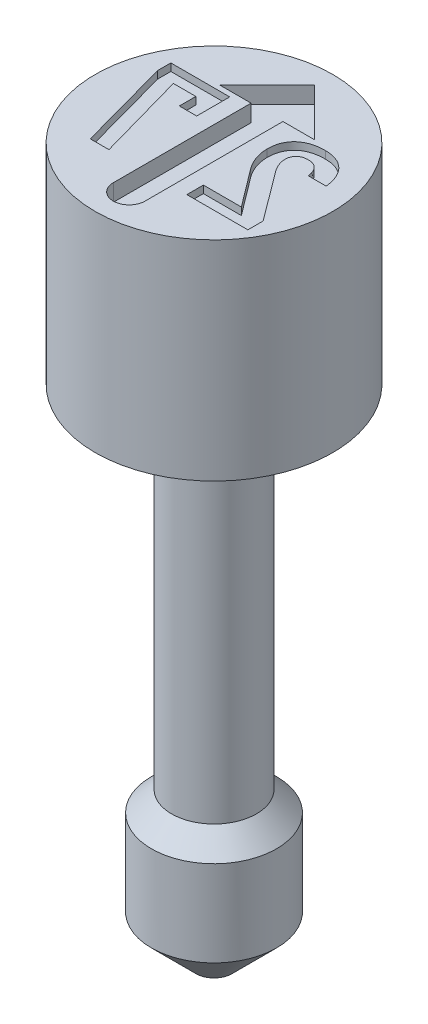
ISO-10303-21;
HEADER;
FILE_DESCRIPTION(('STEP AP214'),'2;1');
FILE_NAME('part.step','',(''),(''),'','','');
FILE_SCHEMA(('AUTOMOTIVE_DESIGN { 1 0 10303 214 1 1 1 1 }'));
ENDSEC;
DATA;
#1=APPLICATION_CONTEXT('core data for automotive mechanical design processes');
#2=APPLICATION_PROTOCOL_DEFINITION('international standard','automotive_design',2000,#1);
#3=PRODUCT_CONTEXT('',#1,'mechanical');
#4=PRODUCT('Part','Part','',(#3));
#5=PRODUCT_RELATED_PRODUCT_CATEGORY('part','',(#4));
#6=PRODUCT_DEFINITION_FORMATION('','',#4);
#7=PRODUCT_DEFINITION_CONTEXT('part definition',#1,'design');
#8=PRODUCT_DEFINITION('design','',#6,#7);
#9=PRODUCT_DEFINITION_SHAPE('','',#8);
#10=(LENGTH_UNIT() NAMED_UNIT(*) SI_UNIT(.MILLI.,.METRE.));
#11=(NAMED_UNIT(*) PLANE_ANGLE_UNIT() SI_UNIT($,.RADIAN.));
#12=(NAMED_UNIT(*) SI_UNIT($,.STERADIAN.) SOLID_ANGLE_UNIT());
#13=UNCERTAINTY_MEASURE_WITH_UNIT(LENGTH_MEASURE(1.E-05),#10,'distance_accuracy_value','');
#14=(GEOMETRIC_REPRESENTATION_CONTEXT(3) GLOBAL_UNCERTAINTY_ASSIGNED_CONTEXT((#13)) GLOBAL_UNIT_ASSIGNED_CONTEXT((#10,
#11,#12)) REPRESENTATION_CONTEXT('',''));
#15=CARTESIAN_POINT('',(0.,0.,0.));
#16=DIRECTION('',(0.,0.,1.));
#17=DIRECTION('',(1.,0.,0.));
#18=AXIS2_PLACEMENT_3D('',#15,#16,#17);
#19=CARTESIAN_POINT('',(0.,17.018,0.));
#20=DIRECTION('',(0.,1.,0.));
#21=DIRECTION('',(0.,0.,1.));
#22=AXIS2_PLACEMENT_3D('',#19,#20,#21);
#23=PLANE('',#22);
#24=DIRECTION('',(1.,0.,0.));
#25=VECTOR('',#24,1.);
#26=CARTESIAN_POINT('',(0.746640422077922,17.018,1.397));
#27=LINE('',#26,#25);
#28=CARTESIAN_POINT('',(0.746640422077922,17.018,1.397));
#29=VERTEX_POINT('',#28);
#30=CARTESIAN_POINT('',(2.20786201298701,17.018,1.397));
#31=VERTEX_POINT('',#30);
#32=EDGE_CURVE('E51',#29,#31,#27,.T.);
#33=ORIENTED_EDGE('',*,*,#32,.F.);
#34=DIRECTION('',(0.,0.,1.));
#35=VECTOR('',#34,1.);
#36=CARTESIAN_POINT('',(0.746640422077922,17.018,1.00115584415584));
#37=LINE('',#36,#35);
#38=CARTESIAN_POINT('',(0.746640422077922,17.018,1.00115584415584));
#39=VERTEX_POINT('',#38);
#40=EDGE_CURVE('E272',#39,#29,#37,.T.);
#41=ORIENTED_EDGE('',*,*,#40,.F.);
#42=DIRECTION('',(-1.,0.,0.));
#43=VECTOR('',#42,1.);
#44=CARTESIAN_POINT('',(1.65636038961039,17.018,1.00115584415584));
#45=LINE('',#44,#43);
#46=CARTESIAN_POINT('',(1.65636038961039,17.018,1.00115584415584));
#47=VERTEX_POINT('',#46);
#48=EDGE_CURVE('E275',#47,#39,#45,.T.);
#49=ORIENTED_EDGE('',*,*,#48,.F.);
#50=DIRECTION('',(0.601464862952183,0.,0.798899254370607));
#51=VECTOR('',#50,1.);
#52=CARTESIAN_POINT('',(0.979611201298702,17.018,0.10225974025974));
#53=LINE('',#52,#51);
#54=CARTESIAN_POINT('',(0.979611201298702,17.018,0.10225974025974));
#55=VERTEX_POINT('',#54);
#56=EDGE_CURVE('E587',#55,#47,#53,.T.);
#57=ORIENTED_EDGE('',*,*,#56,.F.);
#58=CARTESIAN_POINT('',(0.760556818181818,17.018,-0.509030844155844));
#59=CARTESIAN_POINT('',(0.761232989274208,17.018,-0.483045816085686));
#60=CARTESIAN_POINT('',(0.762591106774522,17.018,-0.430853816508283));
#61=CARTESIAN_POINT('',(0.774336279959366,17.018,-0.352325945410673));
#62=CARTESIAN_POINT('',(0.791296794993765,17.018,-0.272982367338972));
#63=CARTESIAN_POINT('',(0.817077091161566,17.018,-0.193967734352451));
#64=CARTESIAN_POINT('',(0.848125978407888,17.018,-0.115731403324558));
#65=CARTESIAN_POINT('',(0.885982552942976,17.018,-0.0400564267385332));
#66=CARTESIAN_POINT('',(0.929184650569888,17.018,0.0332813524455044));
#67=CARTESIAN_POINT('',(0.962723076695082,17.018,0.0791585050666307));
#68=CARTESIAN_POINT('',(0.979611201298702,17.018,0.10225974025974));
#69=B_SPLINE_CURVE_WITH_KNOTS('',3,(#58,#59,#60,#61,#62,#63,#64,#65,#66,#67,#68),.UNSPECIFIED.,
.F.,.F.,(4,1,1,1,1,1,1,1,4),(0.,0.117962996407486,0.236933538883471,0.360005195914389,
0.486119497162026,0.613931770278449,0.74201296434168,0.870091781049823,1.),.UNSPECIFIED.);
#70=CARTESIAN_POINT('',(0.760556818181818,17.018,-0.509030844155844));
#71=VERTEX_POINT('',#70);
#72=EDGE_CURVE('E590',#71,#55,#69,.T.);
#73=ORIENTED_EDGE('',*,*,#72,.F.);
#74=DIRECTION('',(0.,0.,1.));
#75=VECTOR('',#74,1.);
#76=CARTESIAN_POINT('',(0.760556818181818,17.018,-0.510577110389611));
#77=LINE('',#76,#75);
#78=CARTESIAN_POINT('',(0.760556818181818,17.018,-0.510577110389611));
#79=VERTEX_POINT('',#78);
#80=EDGE_CURVE('E595',#79,#71,#77,.T.);
#81=ORIENTED_EDGE('',*,*,#80,.F.);
#82=CARTESIAN_POINT('',(1.4909099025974,17.018,-1.17598701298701));
#83=CARTESIAN_POINT('',(1.46253852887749,17.018,-1.17557382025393));
#84=CARTESIAN_POINT('',(1.4073859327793,17.018,-1.17477059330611));
#85=CARTESIAN_POINT('',(1.32729797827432,17.018,-1.16622385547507));
#86=CARTESIAN_POINT('',(1.25207347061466,17.018,-1.15309829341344));
#87=CARTESIAN_POINT('',(1.18177641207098,17.018,-1.13414225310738));
#88=CARTESIAN_POINT('',(1.11654612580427,17.018,-1.10935076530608));
#89=CARTESIAN_POINT('',(1.05632193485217,17.018,-1.07924708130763));
#90=CARTESIAN_POINT('',(1.00071095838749,17.018,-1.04427070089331));
#91=CARTESIAN_POINT('',(0.950537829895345,17.018,-1.00323568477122));
#92=CARTESIAN_POINT('',(0.90573102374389,17.018,-0.957456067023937));
#93=CARTESIAN_POINT('',(0.866530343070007,17.018,-0.907100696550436));
#94=CARTESIAN_POINT('',(0.834173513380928,17.018,-0.851734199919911));
#95=CARTESIAN_POINT('',(0.80634617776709,17.018,-0.792472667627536));
#96=CARTESIAN_POINT('',(0.786203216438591,17.018,-0.728029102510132));
#97=CARTESIAN_POINT('',(0.771041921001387,17.018,-0.659610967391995));
#98=CARTESIAN_POINT('',(0.762365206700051,17.018,-0.586565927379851));
#99=CARTESIAN_POINT('',(0.761170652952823,17.018,-0.536370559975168));
#100=CARTESIAN_POINT('',(0.760556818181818,17.018,-0.510577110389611));
#101=B_SPLINE_CURVE_WITH_KNOTS('',3,(#82,#83,#84,#85,#86,#87,#88,#89,#90,#91,#92,#93,#94,#95,
#96,#97,#98,#99,#100),.UNSPECIFIED.,.F.,.F.,(4,1,1,1,1,1,1,1,1,1,1,1,1,1,1,1,4),(0.,
0.0757177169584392,0.147191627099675,0.214761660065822,0.279410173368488,0.341256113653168,
0.400743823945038,0.458895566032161,0.516277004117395,0.573364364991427,0.629605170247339,
0.686164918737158,0.744246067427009,0.804009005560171,0.865999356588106,0.931142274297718,1.),.UNSPECIFIED.);
#102=CARTESIAN_POINT('',(1.4909099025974,17.018,-1.17598701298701));
#103=VERTEX_POINT('',#102);
#104=EDGE_CURVE('E601',#103,#79,#101,.T.);
#105=ORIENTED_EDGE('',*,*,#104,.F.);
#106=CARTESIAN_POINT('',(2.23878733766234,17.018,-0.448726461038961));
#107=CARTESIAN_POINT('',(2.23549028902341,17.018,-0.476980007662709));
#108=CARTESIAN_POINT('',(2.22905505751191,17.018,-0.532125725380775));
#109=CARTESIAN_POINT('',(2.21155192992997,17.018,-0.611592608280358));
#110=CARTESIAN_POINT('',(2.19013592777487,17.018,-0.686323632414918));
#111=CARTESIAN_POINT('',(2.163305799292,17.018,-0.756220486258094));
#112=CARTESIAN_POINT('',(2.1312878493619,17.018,-0.821182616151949));
#113=CARTESIAN_POINT('',(2.09479714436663,17.018,-0.881690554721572));
#114=CARTESIAN_POINT('',(2.05201227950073,17.018,-0.936290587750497));
#115=CARTESIAN_POINT('',(2.00532691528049,17.018,-0.986613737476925));
#116=CARTESIAN_POINT('',(1.95354392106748,17.018,-1.03084309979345));
#117=CARTESIAN_POINT('',(1.89816784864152,17.018,-1.06972776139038));
#118=CARTESIAN_POINT('',(1.83921022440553,17.018,-1.10292552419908));
#119=CARTESIAN_POINT('',(1.77647967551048,17.018,-1.12985073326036));
#120=CARTESIAN_POINT('',(1.71007306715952,17.018,-1.15034668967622));
#121=CARTESIAN_POINT('',(1.64025434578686,17.018,-1.16538487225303));
#122=CARTESIAN_POINT('',(1.56672849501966,17.018,-1.17415578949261));
#123=CARTESIAN_POINT('',(1.51653253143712,17.018,-1.17536815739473));
#124=CARTESIAN_POINT('',(1.4909099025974,17.018,-1.17598701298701));
#125=B_SPLINE_CURVE_WITH_KNOTS('',3,(#106,#107,#108,#109,#110,#111,#112,#113,#114,#115,#116,
#117,#118,#119,#120,#121,#122,#123,#124),.UNSPECIFIED.,.F.,.F.,(4,1,1,1,1,1,1,1,1,1,1,1,1,1,1,1,
4),(0.,0.0735286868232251,0.143514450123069,0.210169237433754,0.274454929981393,
0.336856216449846,0.397291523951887,0.456843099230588,0.515945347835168,0.574554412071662,
0.632618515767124,0.690713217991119,0.749236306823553,0.808827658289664,0.870185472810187,
0.933735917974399,1.),.UNSPECIFIED.);
#126=CARTESIAN_POINT('',(2.23878733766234,17.018,-0.448726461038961));
#127=VERTEX_POINT('',#126);
#128=EDGE_CURVE('E606',#127,#103,#125,.T.);
#129=ORIENTED_EDGE('',*,*,#128,.F.);
#130=DIRECTION('',(0.,0.,-1.));
#131=VECTOR('',#130,1.);
#132=CARTESIAN_POINT('',(2.23878733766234,17.018,-0.447180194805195));
#133=LINE('',#132,#131);
#134=CARTESIAN_POINT('',(2.23878733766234,17.018,-0.447180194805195));
#135=VERTEX_POINT('',#134);
#136=EDGE_CURVE('E614',#135,#127,#133,.T.);
#137=ORIENTED_EDGE('',*,*,#136,.F.);
#138=DIRECTION('',(1.,0.,0.));
#139=VECTOR('',#138,1.);
#140=CARTESIAN_POINT('',(1.81098701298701,17.018,-0.447180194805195));
#141=LINE('',#140,#139);
#142=CARTESIAN_POINT('',(1.81098701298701,17.018,-0.447180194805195));
#143=VERTEX_POINT('',#142);
#144=EDGE_CURVE('E620',#143,#135,#141,.T.);
#145=ORIENTED_EDGE('',*,*,#144,.F.);
#146=DIRECTION('',(0.,0.,1.));
#147=VECTOR('',#146,1.);
#148=CARTESIAN_POINT('',(1.81098701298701,17.018,-0.448726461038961));
#149=LINE('',#148,#147);
#150=CARTESIAN_POINT('',(1.81098701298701,17.018,-0.448726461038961));
#151=VERTEX_POINT('',#150);
#152=EDGE_CURVE('E623',#151,#143,#149,.T.);
#153=ORIENTED_EDGE('',*,*,#152,.F.);
#154=CARTESIAN_POINT('',(1.48730194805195,17.018,-0.780142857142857));
#155=CARTESIAN_POINT('',(1.5087368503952,17.018,-0.779343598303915));
#156=CARTESIAN_POINT('',(1.5502418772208,17.018,-0.777795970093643));
#157=CARTESIAN_POINT('',(1.60915560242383,17.018,-0.760309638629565));
#158=CARTESIAN_POINT('',(1.66256678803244,17.018,-0.733442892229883));
#159=CARTESIAN_POINT('',(1.70858991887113,17.018,-0.694620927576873));
#160=CARTESIAN_POINT('',(1.74727125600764,17.018,-0.646229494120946));
#161=CARTESIAN_POINT('',(1.77793475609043,17.018,-0.588646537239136));
#162=CARTESIAN_POINT('',(1.79940260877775,17.018,-0.52170759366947));
#163=CARTESIAN_POINT('',(1.80701071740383,17.018,-0.473776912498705));
#164=CARTESIAN_POINT('',(1.81098701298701,17.018,-0.448726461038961));
#165=B_SPLINE_CURVE_WITH_KNOTS('',3,(#154,#155,#156,#157,#158,#159,#160,#161,#162,#163,#164),
.UNSPECIFIED.,.F.,.F.,(4,1,1,1,1,1,1,1,4),(0.,0.124986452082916,0.242014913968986,
0.356148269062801,0.472436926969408,0.591058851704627,0.716468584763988,0.851815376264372,1.),.UNSPECIFIED.);
#166=CARTESIAN_POINT('',(1.48730194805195,17.018,-0.780142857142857));
#167=VERTEX_POINT('',#166);
#168=EDGE_CURVE('E626',#167,#151,#165,.T.);
#169=ORIENTED_EDGE('',*,*,#168,.F.);
#170=CARTESIAN_POINT('',(1.18990340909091,17.018,-0.510577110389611));
#171=CARTESIAN_POINT('',(1.19059833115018,17.018,-0.530960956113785));
#172=CARTESIAN_POINT('',(1.19192725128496,17.018,-0.569941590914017));
#173=CARTESIAN_POINT('',(1.20734116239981,17.018,-0.624505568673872));
#174=CARTESIAN_POINT('',(1.23184197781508,17.018,-0.671982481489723));
#175=CARTESIAN_POINT('',(1.26677839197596,17.018,-0.71126672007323));
#176=CARTESIAN_POINT('',(1.31024547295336,17.018,-0.7425286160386));
#177=CARTESIAN_POINT('',(1.36217758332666,17.018,-0.765083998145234));
#178=CARTESIAN_POINT('',(1.42229567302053,17.018,-0.777513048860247));
#179=CARTESIAN_POINT('',(1.4649100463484,17.018,-0.779236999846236));
#180=CARTESIAN_POINT('',(1.48730194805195,17.018,-0.780142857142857));
#181=B_SPLINE_CURVE_WITH_KNOTS('',3,(#170,#171,#172,#173,#174,#175,#176,#177,#178,#179,#180),
.UNSPECIFIED.,.F.,.F.,(4,1,1,1,1,1,1,1,4),(0.,0.133827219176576,0.255921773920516,
0.369738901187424,0.482715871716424,0.598532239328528,0.719553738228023,0.85263833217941,1.),.UNSPECIFIED.);
#182=CARTESIAN_POINT('',(1.18990340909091,17.018,-0.510577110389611));
#183=VERTEX_POINT('',#182);
#184=EDGE_CURVE('E631',#183,#167,#181,.T.);
#185=ORIENTED_EDGE('',*,*,#184,.F.);
#186=DIRECTION('',(0.,0.,-1.));
#187=VECTOR('',#186,1.);
#188=CARTESIAN_POINT('',(1.18990340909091,17.018,-0.506969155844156));
#189=LINE('',#188,#187);
#190=CARTESIAN_POINT('',(1.18990340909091,17.018,-0.506969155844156));
#191=VERTEX_POINT('',#190);
#192=EDGE_CURVE('E639',#191,#183,#189,.T.);
#193=ORIENTED_EDGE('',*,*,#192,.F.);
#194=CARTESIAN_POINT('',(1.33267532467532,17.018,-0.142565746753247));
#195=CARTESIAN_POINT('',(1.32184500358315,17.018,-0.157561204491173));
#196=CARTESIAN_POINT('',(1.30048864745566,17.018,-0.187130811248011));
#197=CARTESIAN_POINT('',(1.271910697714,17.018,-0.233105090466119));
#198=CARTESIAN_POINT('',(1.24783679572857,17.018,-0.280151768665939));
#199=CARTESIAN_POINT('',(1.22707710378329,17.018,-0.32740175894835));
#200=CARTESIAN_POINT('',(1.21081740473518,17.018,-0.374306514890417));
#201=CARTESIAN_POINT('',(1.19853273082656,17.018,-0.419873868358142));
#202=CARTESIAN_POINT('',(1.19175624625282,17.018,-0.463986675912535));
#203=CARTESIAN_POINT('',(1.19051155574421,17.018,-0.49286125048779));
#204=CARTESIAN_POINT('',(1.18990340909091,17.018,-0.506969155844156));
#205=B_SPLINE_CURVE_WITH_KNOTS('',3,(#194,#195,#196,#197,#198,#199,#200,#201,#202,#203,#204),
.UNSPECIFIED.,.F.,.F.,(4,1,1,1,1,1,1,1,4),(0.,0.139527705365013,0.275135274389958,
0.407888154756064,0.537917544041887,0.66417107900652,0.782063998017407,0.893518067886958,1.),.UNSPECIFIED.);
#206=CARTESIAN_POINT('',(1.33267532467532,17.018,-0.142565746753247));
#207=VERTEX_POINT('',#206);
#208=EDGE_CURVE('E645',#207,#191,#205,.T.);
#209=ORIENTED_EDGE('',*,*,#208,.F.);
#210=DIRECTION('',(-0.597969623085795,0.,-0.801518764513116));
#211=VECTOR('',#210,1.);
#212=CARTESIAN_POINT('',(2.20786201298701,17.018,1.0305349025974));
#213=LINE('',#212,#211);
#214=CARTESIAN_POINT('',(2.20786201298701,17.018,1.0305349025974));
#215=VERTEX_POINT('',#214);
#216=EDGE_CURVE('E650',#215,#207,#213,.T.);
#217=ORIENTED_EDGE('',*,*,#216,.F.);
#218=DIRECTION('',(0.,0.,-1.));
#219=VECTOR('',#218,1.);
#220=CARTESIAN_POINT('',(2.20786201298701,17.018,1.397));
#221=LINE('',#220,#219);
#222=EDGE_CURVE('E656',#31,#215,#221,.T.);
#223=ORIENTED_EDGE('',*,*,#222,.F.);
#224=EDGE_LOOP('',(#33,#41,#49,#57,#73,#81,#105,#129,#137,#145,#153,#169,#185,#193,#209,#217,#223));
#225=FACE_BOUND('',#224,.T.);
#226=DIRECTION('',(-1.,0.,0.));
#227=VECTOR('',#226,1.);
#228=CARTESIAN_POINT('',(-0.766329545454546,17.018,-1.143));
#229=LINE('',#228,#227);
#230=CARTESIAN_POINT('',(-0.766329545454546,17.018,-1.143));
#231=VERTEX_POINT('',#230);
#232=CARTESIAN_POINT('',(-2.17703977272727,17.018,-1.143));
#233=VERTEX_POINT('',#232);
#234=EDGE_CURVE('E59',#231,#233,#229,.T.);
#235=ORIENTED_EDGE('',*,*,#234,.F.);
#236=DIRECTION('',(0.,0.,-1.));
#237=VECTOR('',#236,1.);
#238=CARTESIAN_POINT('',(-0.766329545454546,17.018,-0.351311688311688));
#239=LINE('',#238,#237);
#240=CARTESIAN_POINT('',(-0.766329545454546,17.018,-0.351311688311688));
#241=VERTEX_POINT('',#240);
#242=EDGE_CURVE('E504',#241,#231,#239,.T.);
#243=ORIENTED_EDGE('',*,*,#242,.F.);
#244=DIRECTION('',(1.,0.,0.));
#245=VECTOR('',#244,1.);
#246=CARTESIAN_POINT('',(-1.18175974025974,17.018,-0.351311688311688));
#247=LINE('',#246,#245);
#248=CARTESIAN_POINT('',(-1.18175974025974,17.018,-0.351311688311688));
#249=VERTEX_POINT('',#248);
#250=EDGE_CURVE('E508',#249,#241,#247,.T.);
#251=ORIENTED_EDGE('',*,*,#250,.F.);
#252=DIRECTION('',(0.,0.,1.));
#253=VECTOR('',#252,1.);
#254=CARTESIAN_POINT('',(-1.18175974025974,17.018,-0.747155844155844));
#255=LINE('',#254,#253);
#256=CARTESIAN_POINT('',(-1.18175974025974,17.018,-0.747155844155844));
#257=VERTEX_POINT('',#256);
#258=EDGE_CURVE('E511',#257,#249,#255,.T.);
#259=ORIENTED_EDGE('',*,*,#258,.F.);
#260=DIRECTION('',(1.,0.,0.));
#261=VECTOR('',#260,1.);
#262=CARTESIAN_POINT('',(-1.72089123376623,17.018,-0.747155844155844));
#263=LINE('',#262,#261);
#264=CARTESIAN_POINT('',(-1.72089123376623,17.018,-0.747155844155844));
#265=VERTEX_POINT('',#264);
#266=EDGE_CURVE('E514',#265,#257,#263,.T.);
#267=ORIENTED_EDGE('',*,*,#266,.F.);
#268=DIRECTION('',(-0.270102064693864,0.,-0.962831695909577));
#269=VECTOR('',#268,1.);
#270=CARTESIAN_POINT('',(-1.11939366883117,17.018,1.397));
#271=LINE('',#270,#269);
#272=CARTESIAN_POINT('',(-1.11939366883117,17.018,1.397));
#273=VERTEX_POINT('',#272);
#274=EDGE_CURVE('E517',#273,#265,#271,.T.);
#275=ORIENTED_EDGE('',*,*,#274,.F.);
#276=DIRECTION('',(1.,0.,0.));
#277=VECTOR('',#276,1.);
#278=CARTESIAN_POINT('',(-1.56626461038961,17.018,1.397));
#279=LINE('',#278,#277);
#280=CARTESIAN_POINT('',(-1.56626461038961,17.018,1.397));
#281=VERTEX_POINT('',#280);
#282=EDGE_CURVE('E520',#281,#273,#279,.T.);
#283=ORIENTED_EDGE('',*,*,#282,.F.);
#284=DIRECTION('',(0.264647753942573,0.,0.964345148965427));
#285=VECTOR('',#284,1.);
#286=CARTESIAN_POINT('',(-2.17703977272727,17.018,-0.828592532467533));
#287=LINE('',#286,#285);
#288=CARTESIAN_POINT('',(-2.17703977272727,17.018,-0.828592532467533));
#289=VERTEX_POINT('',#288);
#290=EDGE_CURVE('E523',#289,#281,#287,.T.);
#291=ORIENTED_EDGE('',*,*,#290,.F.);
#292=DIRECTION('',(0.,0.,1.));
#293=VECTOR('',#292,1.);
#294=CARTESIAN_POINT('',(-2.17703977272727,17.018,-1.143));
#295=LINE('',#294,#293);
#296=EDGE_CURVE('E526',#233,#289,#295,.T.);
#297=ORIENTED_EDGE('',*,*,#296,.F.);
#298=EDGE_LOOP('',(#235,#243,#251,#259,#267,#275,#283,#291,#297));
#299=FACE_BOUND('',#298,.T.);
#300=CARTESIAN_POINT('',(0.,17.018,2.032));
#301=DIRECTION('',(0.,1.,0.));
#302=DIRECTION('',(0.,0.,1.));
#303=AXIS2_PLACEMENT_3D('',#300,#301,#302);
#304=CIRCLE('',#303,0.381);
#305=CARTESIAN_POINT('',(-0.381,17.018,2.032));
#306=VERTEX_POINT('',#305);
#307=CARTESIAN_POINT('',(0.381,17.018,2.032));
#308=VERTEX_POINT('',#307);
#309=EDGE_CURVE('E463',#306,#308,#304,.T.);
#310=ORIENTED_EDGE('',*,*,#309,.F.);
#311=DIRECTION('',(0.,0.,1.));
#312=VECTOR('',#311,1.);
#313=CARTESIAN_POINT('',(-0.381,17.018,2.032));
#314=LINE('',#313,#312);
#315=CARTESIAN_POINT('',(-0.381,17.018,-1.27));
#316=VERTEX_POINT('',#315);
#317=EDGE_CURVE('E444',#316,#306,#314,.T.);
#318=ORIENTED_EDGE('',*,*,#317,.F.);
#319=DIRECTION('',(1.,0.,0.));
#320=VECTOR('',#319,1.);
#321=CARTESIAN_POINT('',(-0.381,17.018,-1.27));
#322=LINE('',#321,#320);
#323=CARTESIAN_POINT('',(-1.143,17.018,-1.27));
#324=VERTEX_POINT('',#323);
#325=EDGE_CURVE('E448',#324,#316,#322,.T.);
#326=ORIENTED_EDGE('',*,*,#325,.F.);
#327=DIRECTION('',(-0.707106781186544,0.,0.707106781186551));
#328=VECTOR('',#327,1.);
#329=CARTESIAN_POINT('',(0.,17.018,-2.41300000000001));
#330=LINE('',#329,#328);
#331=CARTESIAN_POINT('',(0.,17.018,-2.41300000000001));
#332=VERTEX_POINT('',#331);
#333=EDGE_CURVE('E451',#332,#324,#330,.T.);
#334=ORIENTED_EDGE('',*,*,#333,.F.);
#335=DIRECTION('',(-0.707106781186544,0.,-0.707106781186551));
#336=VECTOR('',#335,1.);
#337=CARTESIAN_POINT('',(1.143,17.018,-1.27));
#338=LINE('',#337,#336);
#339=CARTESIAN_POINT('',(1.143,17.018,-1.27));
#340=VERTEX_POINT('',#339);
#341=EDGE_CURVE('E454',#340,#332,#338,.T.);
#342=ORIENTED_EDGE('',*,*,#341,.F.);
#343=DIRECTION('',(1.,0.,0.));
#344=VECTOR('',#343,1.);
#345=CARTESIAN_POINT('',(0.381,17.018,-1.27));
#346=LINE('',#345,#344);
#347=CARTESIAN_POINT('',(0.381,17.018,-1.27));
#348=VERTEX_POINT('',#347);
#349=EDGE_CURVE('E457',#348,#340,#346,.T.);
#350=ORIENTED_EDGE('',*,*,#349,.F.);
#351=DIRECTION('',(0.,0.,-1.));
#352=VECTOR('',#351,1.);
#353=CARTESIAN_POINT('',(0.381,17.018,2.032));
#354=LINE('',#353,#352);
#355=EDGE_CURVE('E460',#308,#348,#354,.T.);
#356=ORIENTED_EDGE('',*,*,#355,.F.);
#357=EDGE_LOOP('',(#310,#318,#326,#334,#342,#350,#356));
#358=FACE_BOUND('',#357,.T.);
#359=CARTESIAN_POINT('',(0.,17.018,0.));
#360=DIRECTION('',(0.,-1.,0.));
#361=DIRECTION('',(0.,0.,-1.));
#362=AXIS2_PLACEMENT_3D('',#359,#360,#361);
#363=CIRCLE('',#362,2.8448);
#364=CARTESIAN_POINT('',(0.,17.018,-2.8448));
#365=VERTEX_POINT('',#364);
#366=EDGE_CURVE('E11',#365,#365,#363,.T.);
#367=ORIENTED_EDGE('',*,*,#366,.F.);
#368=EDGE_LOOP('',(#367));
#369=FACE_BOUND('',#368,.T.);
#370=ADVANCED_FACE('F37',(#225,#299,#358,#369),#23,.T.);
#371=CARTESIAN_POINT('',(0.,0.,0.));
#372=DIRECTION('',(0.,-1.,0.));
#373=DIRECTION('',(0.,0.,-1.));
#374=AXIS2_PLACEMENT_3D('',#371,#372,#373);
#375=CYLINDRICAL_SURFACE('',#374,2.8448);
#376=ORIENTED_EDGE('',*,*,#366,.T.);
#377=EDGE_LOOP('',(#376));
#378=FACE_BOUND('',#377,.T.);
#379=CARTESIAN_POINT('',(0.,12.0142,0.));
#380=DIRECTION('',(0.,-1.,0.));
#381=DIRECTION('',(0.,0.,-1.));
#382=AXIS2_PLACEMENT_3D('',#379,#380,#381);
#383=CIRCLE('',#382,2.8448);
#384=CARTESIAN_POINT('',(0.,12.0142,-2.8448));
#385=VERTEX_POINT('',#384);
#386=EDGE_CURVE('E44',#385,#385,#383,.T.);
#387=ORIENTED_EDGE('',*,*,#386,.F.);
#388=EDGE_LOOP('',(#387));
#389=FACE_BOUND('',#388,.T.);
#390=ADVANCED_FACE('F400',(#378,#389),#375,.T.);
#391=CARTESIAN_POINT('',(2.8448,12.0142,0.));
#392=DIRECTION('',(0.,-1.,0.));
#393=DIRECTION('',(0.,0.,-1.));
#394=AXIS2_PLACEMENT_3D('',#391,#392,#393);
#395=PLANE('',#394);
#396=ORIENTED_EDGE('',*,*,#386,.T.);
#397=EDGE_LOOP('',(#396));
#398=FACE_BOUND('',#397,.T.);
#399=CARTESIAN_POINT('',(0.,12.0142,0.));
#400=DIRECTION('',(0.,-1.,0.));
#401=DIRECTION('',(0.,0.,-1.));
#402=AXIS2_PLACEMENT_3D('',#399,#400,#401);
#403=CIRCLE('',#402,1.016);
#404=CARTESIAN_POINT('',(0.,12.0142,-1.016));
#405=VERTEX_POINT('',#404);
#406=EDGE_CURVE('E412',#405,#405,#403,.T.);
#407=ORIENTED_EDGE('',*,*,#406,.F.);
#408=EDGE_LOOP('',(#407));
#409=FACE_BOUND('',#408,.T.);
#410=ADVANCED_FACE('F397',(#398,#409),#395,.T.);
#411=CARTESIAN_POINT('',(0.,0.,0.));
#412=DIRECTION('',(0.,-1.,0.));
#413=DIRECTION('',(0.,0.,-1.));
#414=AXIS2_PLACEMENT_3D('',#411,#412,#413);
#415=CYLINDRICAL_SURFACE('',#414,1.016);
#416=ORIENTED_EDGE('',*,*,#406,.T.);
#417=EDGE_LOOP('',(#416));
#418=FACE_BOUND('',#417,.T.);
#419=CARTESIAN_POINT('',(0.,3.6068,0.));
#420=DIRECTION('',(0.,-1.,0.));
#421=DIRECTION('',(0.,0.,-1.));
#422=AXIS2_PLACEMENT_3D('',#419,#420,#421);
#423=CIRCLE('',#422,1.016);
#424=CARTESIAN_POINT('',(0.,3.6068,-1.016));
#425=VERTEX_POINT('',#424);
#426=EDGE_CURVE('E414',#425,#425,#423,.T.);
#427=ORIENTED_EDGE('',*,*,#426,.F.);
#428=EDGE_LOOP('',(#427));
#429=FACE_BOUND('',#428,.T.);
#430=ADVANCED_FACE('F393',(#418,#429),#415,.T.);
#431=CARTESIAN_POINT('',(0.,3.12420000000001,0.));
#432=DIRECTION('',(0.,-1.,0.));
#433=DIRECTION('',(0.,0.,-1.));
#434=AXIS2_PLACEMENT_3D('',#431,#432,#433);
#435=CONICAL_SURFACE('',#434,1.4986,0.785398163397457);
#436=ORIENTED_EDGE('',*,*,#426,.T.);
#437=EDGE_LOOP('',(#436));
#438=FACE_BOUND('',#437,.T.);
#439=CARTESIAN_POINT('',(0.,3.12420000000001,0.));
#440=DIRECTION('',(0.,-1.,0.));
#441=DIRECTION('',(0.,0.,-1.));
#442=AXIS2_PLACEMENT_3D('',#439,#440,#441);
#443=CIRCLE('',#442,1.4986);
#444=CARTESIAN_POINT('',(0.,3.12420000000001,-1.4986));
#445=VERTEX_POINT('',#444);
#446=EDGE_CURVE('E419',#445,#445,#443,.T.);
#447=ORIENTED_EDGE('',*,*,#446,.F.);
#448=EDGE_LOOP('',(#447));
#449=FACE_BOUND('',#448,.T.);
#450=ADVANCED_FACE('F389',(#438,#449),#435,.T.);
#451=CARTESIAN_POINT('',(0.,0.,0.));
#452=DIRECTION('',(0.,-1.,0.));
#453=DIRECTION('',(0.,0.,-1.));
#454=AXIS2_PLACEMENT_3D('',#451,#452,#453);
#455=CYLINDRICAL_SURFACE('',#454,1.4986);
#456=ORIENTED_EDGE('',*,*,#446,.T.);
#457=EDGE_LOOP('',(#456));
#458=FACE_BOUND('',#457,.T.);
#459=CARTESIAN_POINT('',(0.,1.0668,0.));
#460=DIRECTION('',(0.,-1.,0.));
#461=DIRECTION('',(0.,0.,-1.));
#462=AXIS2_PLACEMENT_3D('',#459,#460,#461);
#463=CIRCLE('',#462,1.4986);
#464=CARTESIAN_POINT('',(0.,1.0668,1.4986));
#465=VERTEX_POINT('',#464);
#466=EDGE_CURVE('E422',#465,#465,#463,.T.);
#467=ORIENTED_EDGE('',*,*,#466,.F.);
#468=EDGE_LOOP('',(#467));
#469=FACE_BOUND('',#468,.T.);
#470=ADVANCED_FACE('F385',(#458,#469),#455,.T.);
#471=CARTESIAN_POINT('',(0.,0.,0.));
#472=DIRECTION('',(0.,1.,0.));
#473=DIRECTION('',(0.,0.,1.));
#474=AXIS2_PLACEMENT_3D('',#471,#472,#473);
#475=CONICAL_SURFACE('',#474,0.431800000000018,0.78539816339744);
#476=CARTESIAN_POINT('',(0.,0.,0.));
#477=DIRECTION('',(0.,-1.,0.));
#478=DIRECTION('',(0.,0.,-1.));
#479=AXIS2_PLACEMENT_3D('',#476,#477,#478);
#480=CIRCLE('',#479,0.431800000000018);
#481=CARTESIAN_POINT('',(0.,0.,0.431800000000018));
#482=VERTEX_POINT('',#481);
#483=EDGE_CURVE('E425',#482,#482,#480,.T.);
#484=CARTESIAN_POINT('',(0.,1.0668,1.4986));
#485=CARTESIAN_POINT('',(0.,1.0556875,1.4874875));
#486=CARTESIAN_POINT('',(0.,1.044575,1.476375));
#487=CARTESIAN_POINT('',(0.,1.02235,1.45415));
#488=CARTESIAN_POINT('',(0.,1.0112375,1.4430375));
#489=CARTESIAN_POINT('',(0.,0.9890125,1.4208125));
#490=CARTESIAN_POINT('',(0.,0.977900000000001,1.4097));
#491=CARTESIAN_POINT('',(0.,0.955675,1.387475));
#492=CARTESIAN_POINT('',(0.,0.944562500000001,1.3763625));
#493=CARTESIAN_POINT('',(0.,0.9223375,1.3541375));
#494=CARTESIAN_POINT('',(0.,0.911225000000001,1.343025));
#495=CARTESIAN_POINT('',(0.,0.889,1.3208));
#496=CARTESIAN_POINT('',(0.,0.8778875,1.3096875));
#497=CARTESIAN_POINT('',(0.,0.8556625,1.2874625));
#498=CARTESIAN_POINT('',(0.,0.84455,1.27635));
#499=CARTESIAN_POINT('',(0.,0.822325,1.254125));
#500=CARTESIAN_POINT('',(0.,0.8112125,1.2430125));
#501=CARTESIAN_POINT('',(0.,0.7889875,1.2207875));
#502=CARTESIAN_POINT('',(0.,0.777875,1.20967500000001));
#503=CARTESIAN_POINT('',(0.,0.75565,1.18745000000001));
#504=CARTESIAN_POINT('',(0.,0.744537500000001,1.17633750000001));
#505=CARTESIAN_POINT('',(0.,0.7223125,1.15411250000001));
#506=CARTESIAN_POINT('',(0.,0.7112,1.14300000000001));
#507=CARTESIAN_POINT('',(0.,0.688975,1.12077500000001));
#508=CARTESIAN_POINT('',(0.,0.6778625,1.10966250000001));
#509=CARTESIAN_POINT('',(0.,0.6556375,1.08743750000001));
#510=CARTESIAN_POINT('',(0.,0.644525,1.07632500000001));
#511=CARTESIAN_POINT('',(0.,0.6223,1.05410000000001));
#512=CARTESIAN_POINT('',(0.,0.6111875,1.04298750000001));
#513=CARTESIAN_POINT('',(0.,0.5889625,1.02076250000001));
#514=CARTESIAN_POINT('',(0.,0.57785,1.00965000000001));
#515=CARTESIAN_POINT('',(0.,0.555625,0.987425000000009));
#516=CARTESIAN_POINT('',(0.,0.5445125,0.976312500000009));
#517=CARTESIAN_POINT('',(0.,0.5222875,0.954087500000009));
#518=CARTESIAN_POINT('',(0.,0.511175,0.94297500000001));
#519=CARTESIAN_POINT('',(0.,0.48895,0.92075000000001));
#520=CARTESIAN_POINT('',(0.,0.4778375,0.90963750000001));
#521=CARTESIAN_POINT('',(0.,0.4556125,0.88741250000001));
#522=CARTESIAN_POINT('',(0.,0.4445,0.876300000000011));
#523=CARTESIAN_POINT('',(0.,0.422275,0.854075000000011));
#524=CARTESIAN_POINT('',(0.,0.4111625,0.842962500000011));
#525=CARTESIAN_POINT('',(0.,0.3889375,0.820737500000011));
#526=CARTESIAN_POINT('',(0.,0.377825,0.809625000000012));
#527=CARTESIAN_POINT('',(0.,0.3556,0.787400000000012));
#528=CARTESIAN_POINT('',(0.,0.3444875,0.776287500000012));
#529=CARTESIAN_POINT('',(0.,0.3222625,0.754062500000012));
#530=CARTESIAN_POINT('',(0.,0.31115,0.742950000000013));
#531=CARTESIAN_POINT('',(0.,0.288925,0.720725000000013));
#532=CARTESIAN_POINT('',(0.,0.2778125,0.709612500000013));
#533=CARTESIAN_POINT('',(0.,0.2555875,0.687387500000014));
#534=CARTESIAN_POINT('',(0.,0.244475,0.676275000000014));
#535=CARTESIAN_POINT('',(0.,0.22225,0.654050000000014));
#536=CARTESIAN_POINT('',(0.,0.2111375,0.642937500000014));
#537=CARTESIAN_POINT('',(0.,0.1889125,0.620712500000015));
#538=CARTESIAN_POINT('',(0.,0.1778,0.609600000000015));
#539=CARTESIAN_POINT('',(0.,0.155575,0.587375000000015));
#540=CARTESIAN_POINT('',(0.,0.1444625,0.576262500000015));
#541=CARTESIAN_POINT('',(0.,0.1222375,0.554037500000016));
#542=CARTESIAN_POINT('',(0.,0.111125,0.542925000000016));
#543=CARTESIAN_POINT('',(0.,0.0889,0.520700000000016));
#544=CARTESIAN_POINT('',(0.,0.0777875,0.509587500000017));
#545=CARTESIAN_POINT('',(0.,0.0555625,0.487362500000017));
#546=CARTESIAN_POINT('',(0.,0.04445,0.476250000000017));
#547=CARTESIAN_POINT('',(0.,0.022225,0.454025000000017));
#548=CARTESIAN_POINT('',(0.,0.0111125,0.442912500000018));
#549=CARTESIAN_POINT('',(0.,0.,0.431800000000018));
#550=B_SPLINE_CURVE_WITH_KNOTS('',3,(#484,#485,#486,#487,#488,#489,#490,#491,#492,#493,#494,
#495,#496,#497,#498,#499,#500,#501,#502,#503,#504,#505,#506,#507,#508,#509,#510,#511,#512,#513,
#514,#515,#516,#517,#518,#519,#520,#521,#522,#523,#524,#525,#526,#527,#528,#529,#530,#531,#532,
#533,#534,#535,#536,#537,#538,#539,#540,#541,#542,#543,#544,#545,#546,#547,#548,#549),
.UNSPECIFIED.,.F.,.F.,(4,2,2,2,2,2,2,2,2,2,2,2,2,2,2,2,2,2,2,2,2,2,2,2,2,2,2,2,2,2,2,2,4),(0.,
0.0471463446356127,0.0942926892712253,0.141439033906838,0.188585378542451,0.235731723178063,
0.282878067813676,0.330024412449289,0.377170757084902,0.424317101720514,0.471463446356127,
0.51860979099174,0.565756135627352,0.612902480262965,0.660048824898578,0.70719516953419,
0.754341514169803,0.801487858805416,0.848634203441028,0.895780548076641,0.942926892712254,
0.990073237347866,1.03721958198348,1.08436592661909,1.1315122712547,1.17865861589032,
1.22580496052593,1.27295130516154,1.32009764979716,1.36724399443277,1.41439033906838,
1.46153668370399,1.50868302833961),.UNSPECIFIED.);
#551=EDGE_CURVE('BSEAM381',#465,#482,#550,.T.);
#552=ORIENTED_EDGE('',*,*,#466,.T.);
#553=ORIENTED_EDGE('',*,*,#483,.F.);
#554=ORIENTED_EDGE('',*,*,#551,.T.);
#555=ORIENTED_EDGE('',*,*,#551,.F.);
#556=EDGE_LOOP('',(#552,#554,#553,#555));
#557=FACE_BOUND('',#556,.T.);
#558=ADVANCED_FACE('F381',(#557),#475,.T.);
#559=CARTESIAN_POINT('',(0.431800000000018,0.,0.));
#560=DIRECTION('',(0.,-1.,0.));
#561=DIRECTION('',(0.,0.,-1.));
#562=AXIS2_PLACEMENT_3D('',#559,#560,#561);
#563=PLANE('',#562);
#564=ORIENTED_EDGE('',*,*,#483,.T.);
#565=EDGE_LOOP('',(#564));
#566=FACE_BOUND('',#565,.T.);
#567=ADVANCED_FACE('F377',(#566),#563,.T.);
#568=CARTESIAN_POINT('',(0.,16.6116,2.032));
#569=DIRECTION('',(0.,1.,0.));
#570=DIRECTION('',(0.,0.,1.));
#571=AXIS2_PLACEMENT_3D('',#568,#569,#570);
#572=CYLINDRICAL_SURFACE('',#571,0.381);
#573=ORIENTED_EDGE('',*,*,#309,.T.);
#574=DIRECTION('',(0.,1.,0.));
#575=VECTOR('',#574,1.);
#576=CARTESIAN_POINT('',(0.381,16.6116,2.032));
#577=LINE('',#576,#575);
#578=CARTESIAN_POINT('',(0.381,16.6116,2.032));
#579=VERTEX_POINT('',#578);
#580=EDGE_CURVE('E429',#579,#308,#577,.T.);
#581=ORIENTED_EDGE('',*,*,#580,.F.);
#582=CARTESIAN_POINT('',(0.,16.6116,2.032));
#583=DIRECTION('',(0.,1.,0.));
#584=DIRECTION('',(0.,0.,1.));
#585=AXIS2_PLACEMENT_3D('',#582,#583,#584);
#586=CIRCLE('',#585,0.381);
#587=CARTESIAN_POINT('',(-0.381,16.6116,2.032));
#588=VERTEX_POINT('',#587);
#589=EDGE_CURVE('E447',#588,#579,#586,.T.);
#590=ORIENTED_EDGE('',*,*,#589,.F.);
#591=DIRECTION('',(0.,1.,0.));
#592=VECTOR('',#591,1.);
#593=CARTESIAN_POINT('',(-0.381,16.6116,2.032));
#594=LINE('',#593,#592);
#595=EDGE_CURVE('E428',#588,#306,#594,.T.);
#596=ORIENTED_EDGE('',*,*,#595,.T.);
#597=EDGE_LOOP('',(#573,#581,#590,#596));
#598=FACE_BOUND('',#597,.T.);
#599=ADVANCED_FACE('F355',(#598),#572,.F.);
#600=CARTESIAN_POINT('',(-0.381,16.6116,2.032));
#601=DIRECTION('',(-1.,0.,0.));
#602=DIRECTION('',(0.,0.,1.));
#603=AXIS2_PLACEMENT_3D('',#600,#601,#602);
#604=PLANE('',#603);
#605=ORIENTED_EDGE('',*,*,#317,.T.);
#606=ORIENTED_EDGE('',*,*,#595,.F.);
#607=DIRECTION('',(0.,0.,1.));
#608=VECTOR('',#607,1.);
#609=CARTESIAN_POINT('',(-0.381,16.6116,2.032));
#610=LINE('',#609,#608);
#611=CARTESIAN_POINT('',(-0.381,16.6116,-1.27));
#612=VERTEX_POINT('',#611);
#613=EDGE_CURVE('E433',#612,#588,#610,.T.);
#614=ORIENTED_EDGE('',*,*,#613,.F.);
#615=DIRECTION('',(0.,1.,0.));
#616=VECTOR('',#615,1.);
#617=CARTESIAN_POINT('',(-0.381,16.6116,-1.27));
#618=LINE('',#617,#616);
#619=EDGE_CURVE('E441',#612,#316,#618,.T.);
#620=ORIENTED_EDGE('',*,*,#619,.T.);
#621=EDGE_LOOP('',(#605,#606,#614,#620));
#622=FACE_BOUND('',#621,.T.);
#623=ADVANCED_FACE('F351',(#622),#604,.F.);
#624=CARTESIAN_POINT('',(-0.381,16.6116,-1.27));
#625=DIRECTION('',(0.,0.,1.));
#626=DIRECTION('',(1.,0.,0.));
#627=AXIS2_PLACEMENT_3D('',#624,#625,#626);
#628=PLANE('',#627);
#629=ORIENTED_EDGE('',*,*,#325,.T.);
#630=ORIENTED_EDGE('',*,*,#619,.F.);
#631=DIRECTION('',(1.,0.,0.));
#632=VECTOR('',#631,1.);
#633=CARTESIAN_POINT('',(-0.381,16.6116,-1.27));
#634=LINE('',#633,#632);
#635=CARTESIAN_POINT('',(-1.143,16.6116,-1.27));
#636=VERTEX_POINT('',#635);
#637=EDGE_CURVE('E468',#636,#612,#634,.T.);
#638=ORIENTED_EDGE('',*,*,#637,.F.);
#639=DIRECTION('',(0.,1.,0.));
#640=VECTOR('',#639,1.);
#641=CARTESIAN_POINT('',(-1.143,16.6116,-1.27));
#642=LINE('',#641,#640);
#643=EDGE_CURVE('E439',#636,#324,#642,.T.);
#644=ORIENTED_EDGE('',*,*,#643,.T.);
#645=EDGE_LOOP('',(#629,#630,#638,#644));
#646=FACE_BOUND('',#645,.T.);
#647=ADVANCED_FACE('F354',(#646),#628,.F.);
#648=CARTESIAN_POINT('',(0.,16.6116,-2.41300000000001));
#649=DIRECTION('',(-0.707106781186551,0.,-0.707106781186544));
#650=DIRECTION('',(-0.707106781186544,0.,0.707106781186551));
#651=AXIS2_PLACEMENT_3D('',#648,#649,#650);
#652=PLANE('',#651);
#653=ORIENTED_EDGE('',*,*,#333,.T.);
#654=ORIENTED_EDGE('',*,*,#643,.F.);
#655=DIRECTION('',(-0.707106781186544,0.,0.707106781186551));
#656=VECTOR('',#655,1.);
#657=CARTESIAN_POINT('',(0.,16.6116,-2.41300000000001));
#658=LINE('',#657,#656);
#659=CARTESIAN_POINT('',(0.,16.6116,-2.41300000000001));
#660=VERTEX_POINT('',#659);
#661=EDGE_CURVE('E471',#660,#636,#658,.T.);
#662=ORIENTED_EDGE('',*,*,#661,.F.);
#663=DIRECTION('',(0.,1.,0.));
#664=VECTOR('',#663,1.);
#665=CARTESIAN_POINT('',(0.,16.6116,-2.41300000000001));
#666=LINE('',#665,#664);
#667=EDGE_CURVE('E437',#660,#332,#666,.T.);
#668=ORIENTED_EDGE('',*,*,#667,.T.);
#669=EDGE_LOOP('',(#653,#654,#662,#668));
#670=FACE_BOUND('',#669,.T.);
#671=ADVANCED_FACE('F359',(#670),#652,.F.);
#672=CARTESIAN_POINT('',(1.143,16.6116,-1.27));
#673=DIRECTION('',(0.707106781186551,0.,-0.707106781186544));
#674=DIRECTION('',(-0.707106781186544,0.,-0.707106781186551));
#675=AXIS2_PLACEMENT_3D('',#672,#673,#674);
#676=PLANE('',#675);
#677=ORIENTED_EDGE('',*,*,#341,.T.);
#678=ORIENTED_EDGE('',*,*,#667,.F.);
#679=DIRECTION('',(-0.707106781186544,0.,-0.707106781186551));
#680=VECTOR('',#679,1.);
#681=CARTESIAN_POINT('',(1.143,16.6116,-1.27));
#682=LINE('',#681,#680);
#683=CARTESIAN_POINT('',(1.143,16.6116,-1.27));
#684=VERTEX_POINT('',#683);
#685=EDGE_CURVE('E474',#684,#660,#682,.T.);
#686=ORIENTED_EDGE('',*,*,#685,.F.);
#687=DIRECTION('',(0.,1.,0.));
#688=VECTOR('',#687,1.);
#689=CARTESIAN_POINT('',(1.143,16.6116,-1.27));
#690=LINE('',#689,#688);
#691=EDGE_CURVE('E435',#684,#340,#690,.T.);
#692=ORIENTED_EDGE('',*,*,#691,.T.);
#693=EDGE_LOOP('',(#677,#678,#686,#692));
#694=FACE_BOUND('',#693,.T.);
#695=ADVANCED_FACE('F363',(#694),#676,.F.);
#696=CARTESIAN_POINT('',(0.381,16.6116,-1.27));
#697=DIRECTION('',(0.,0.,1.));
#698=DIRECTION('',(1.,0.,0.));
#699=AXIS2_PLACEMENT_3D('',#696,#697,#698);
#700=PLANE('',#699);
#701=ORIENTED_EDGE('',*,*,#349,.T.);
#702=ORIENTED_EDGE('',*,*,#691,.F.);
#703=DIRECTION('',(1.,0.,0.));
#704=VECTOR('',#703,1.);
#705=CARTESIAN_POINT('',(0.381,16.6116,-1.27));
#706=LINE('',#705,#704);
#707=CARTESIAN_POINT('',(0.381,16.6116,-1.27));
#708=VERTEX_POINT('',#707);
#709=EDGE_CURVE('E477',#708,#684,#706,.T.);
#710=ORIENTED_EDGE('',*,*,#709,.F.);
#711=DIRECTION('',(0.,1.,0.));
#712=VECTOR('',#711,1.);
#713=CARTESIAN_POINT('',(0.381,16.6116,-1.27));
#714=LINE('',#713,#712);
#715=EDGE_CURVE('E432',#708,#348,#714,.T.);
#716=ORIENTED_EDGE('',*,*,#715,.T.);
#717=EDGE_LOOP('',(#701,#702,#710,#716));
#718=FACE_BOUND('',#717,.T.);
#719=ADVANCED_FACE('F367',(#718),#700,.F.);
#720=CARTESIAN_POINT('',(0.381,16.6116,2.032));
#721=DIRECTION('',(1.,0.,0.));
#722=DIRECTION('',(0.,0.,-1.));
#723=AXIS2_PLACEMENT_3D('',#720,#721,#722);
#724=PLANE('',#723);
#725=ORIENTED_EDGE('',*,*,#355,.T.);
#726=ORIENTED_EDGE('',*,*,#715,.F.);
#727=DIRECTION('',(0.,0.,-1.));
#728=VECTOR('',#727,1.);
#729=CARTESIAN_POINT('',(0.381,16.6116,2.032));
#730=LINE('',#729,#728);
#731=EDGE_CURVE('E480',#579,#708,#730,.T.);
#732=ORIENTED_EDGE('',*,*,#731,.F.);
#733=ORIENTED_EDGE('',*,*,#580,.T.);
#734=EDGE_LOOP('',(#725,#726,#732,#733));
#735=FACE_BOUND('',#734,.T.);
#736=ADVANCED_FACE('F349',(#735),#724,.F.);
#737=CARTESIAN_POINT('',(0.,16.6116,2.032));
#738=DIRECTION('',(0.,1.,0.));
#739=DIRECTION('',(0.,0.,1.));
#740=AXIS2_PLACEMENT_3D('',#737,#738,#739);
#741=PLANE('',#740);
#742=ORIENTED_EDGE('',*,*,#589,.T.);
#743=ORIENTED_EDGE('',*,*,#731,.T.);
#744=ORIENTED_EDGE('',*,*,#709,.T.);
#745=ORIENTED_EDGE('',*,*,#685,.T.);
#746=ORIENTED_EDGE('',*,*,#661,.T.);
#747=ORIENTED_EDGE('',*,*,#637,.T.);
#748=ORIENTED_EDGE('',*,*,#613,.T.);
#749=EDGE_LOOP('',(#742,#743,#744,#745,#746,#747,#748));
#750=FACE_BOUND('',#749,.T.);
#751=ADVANCED_FACE('F346',(#750),#741,.T.);
#752=CARTESIAN_POINT('',(-0.766329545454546,16.8402,-1.143));
#753=DIRECTION('',(0.,0.,-1.));
#754=DIRECTION('',(-1.,0.,0.));
#755=AXIS2_PLACEMENT_3D('',#752,#753,#754);
#756=PLANE('',#755);
#757=ORIENTED_EDGE('',*,*,#234,.T.);
#758=DIRECTION('',(0.,1.,0.));
#759=VECTOR('',#758,1.);
#760=CARTESIAN_POINT('',(-2.17703977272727,16.8402,-1.143));
#761=LINE('',#760,#759);
#762=CARTESIAN_POINT('',(-2.17703977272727,16.8402,-1.143));
#763=VERTEX_POINT('',#762);
#764=EDGE_CURVE('E485',#763,#233,#761,.T.);
#765=ORIENTED_EDGE('',*,*,#764,.F.);
#766=DIRECTION('',(-1.,0.,0.));
#767=VECTOR('',#766,1.);
#768=CARTESIAN_POINT('',(-0.766329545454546,16.8402,-1.143));
#769=LINE('',#768,#767);
#770=CARTESIAN_POINT('',(-0.766329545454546,16.8402,-1.143));
#771=VERTEX_POINT('',#770);
#772=EDGE_CURVE('E507',#771,#763,#769,.T.);
#773=ORIENTED_EDGE('',*,*,#772,.F.);
#774=DIRECTION('',(0.,1.,0.));
#775=VECTOR('',#774,1.);
#776=CARTESIAN_POINT('',(-0.766329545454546,16.8402,-1.143));
#777=LINE('',#776,#775);
#778=EDGE_CURVE('E502',#771,#231,#777,.T.);
#779=ORIENTED_EDGE('',*,*,#778,.T.);
#780=EDGE_LOOP('',(#757,#765,#773,#779));
#781=FACE_BOUND('',#780,.T.);
#782=ADVANCED_FACE('F316',(#781),#756,.F.);
#783=CARTESIAN_POINT('',(-0.766329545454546,16.8402,-0.351311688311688));
#784=DIRECTION('',(1.,0.,0.));
#785=DIRECTION('',(0.,0.,-1.));
#786=AXIS2_PLACEMENT_3D('',#783,#784,#785);
#787=PLANE('',#786);
#788=ORIENTED_EDGE('',*,*,#242,.T.);
#789=ORIENTED_EDGE('',*,*,#778,.F.);
#790=DIRECTION('',(0.,0.,-1.));
#791=VECTOR('',#790,1.);
#792=CARTESIAN_POINT('',(-0.766329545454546,16.8402,-0.351311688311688));
#793=LINE('',#792,#791);
#794=CARTESIAN_POINT('',(-0.766329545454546,16.8402,-0.351311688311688));
#795=VERTEX_POINT('',#794);
#796=EDGE_CURVE('E488',#795,#771,#793,.T.);
#797=ORIENTED_EDGE('',*,*,#796,.F.);
#798=DIRECTION('',(0.,1.,0.));
#799=VECTOR('',#798,1.);
#800=CARTESIAN_POINT('',(-0.766329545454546,16.8402,-0.351311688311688));
#801=LINE('',#800,#799);
#802=EDGE_CURVE('E500',#795,#241,#801,.T.);
#803=ORIENTED_EDGE('',*,*,#802,.T.);
#804=EDGE_LOOP('',(#788,#789,#797,#803));
#805=FACE_BOUND('',#804,.T.);
#806=ADVANCED_FACE('F312',(#805),#787,.F.);
#807=CARTESIAN_POINT('',(-1.18175974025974,16.8402,-0.351311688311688));
#808=DIRECTION('',(0.,0.,1.));
#809=DIRECTION('',(1.,0.,0.));
#810=AXIS2_PLACEMENT_3D('',#807,#808,#809);
#811=PLANE('',#810);
#812=ORIENTED_EDGE('',*,*,#250,.T.);
#813=ORIENTED_EDGE('',*,*,#802,.F.);
#814=DIRECTION('',(1.,0.,0.));
#815=VECTOR('',#814,1.);
#816=CARTESIAN_POINT('',(-1.18175974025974,16.8402,-0.351311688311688));
#817=LINE('',#816,#815);
#818=CARTESIAN_POINT('',(-1.18175974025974,16.8402,-0.351311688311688));
#819=VERTEX_POINT('',#818);
#820=EDGE_CURVE('E532',#819,#795,#817,.T.);
#821=ORIENTED_EDGE('',*,*,#820,.F.);
#822=DIRECTION('',(0.,1.,0.));
#823=VECTOR('',#822,1.);
#824=CARTESIAN_POINT('',(-1.18175974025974,16.8402,-0.351311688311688));
#825=LINE('',#824,#823);
#826=EDGE_CURVE('E498',#819,#249,#825,.T.);
#827=ORIENTED_EDGE('',*,*,#826,.T.);
#828=EDGE_LOOP('',(#812,#813,#821,#827));
#829=FACE_BOUND('',#828,.T.);
#830=ADVANCED_FACE('F315',(#829),#811,.F.);
#831=CARTESIAN_POINT('',(-1.18175974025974,16.8402,-0.747155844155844));
#832=DIRECTION('',(-1.,0.,0.));
#833=DIRECTION('',(0.,0.,1.));
#834=AXIS2_PLACEMENT_3D('',#831,#832,#833);
#835=PLANE('',#834);
#836=ORIENTED_EDGE('',*,*,#258,.T.);
#837=ORIENTED_EDGE('',*,*,#826,.F.);
#838=DIRECTION('',(0.,0.,1.));
#839=VECTOR('',#838,1.);
#840=CARTESIAN_POINT('',(-1.18175974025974,16.8402,-0.747155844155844));
#841=LINE('',#840,#839);
#842=CARTESIAN_POINT('',(-1.18175974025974,16.8402,-0.747155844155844));
#843=VERTEX_POINT('',#842);
#844=EDGE_CURVE('E535',#843,#819,#841,.T.);
#845=ORIENTED_EDGE('',*,*,#844,.F.);
#846=DIRECTION('',(0.,1.,0.));
#847=VECTOR('',#846,1.);
#848=CARTESIAN_POINT('',(-1.18175974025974,16.8402,-0.747155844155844));
#849=LINE('',#848,#847);
#850=EDGE_CURVE('E496',#843,#257,#849,.T.);
#851=ORIENTED_EDGE('',*,*,#850,.T.);
#852=EDGE_LOOP('',(#836,#837,#845,#851));
#853=FACE_BOUND('',#852,.T.);
#854=ADVANCED_FACE('F320',(#853),#835,.F.);
#855=CARTESIAN_POINT('',(-1.72089123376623,16.8402,-0.747155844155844));
#856=DIRECTION('',(0.,0.,1.));
#857=DIRECTION('',(1.,0.,0.));
#858=AXIS2_PLACEMENT_3D('',#855,#856,#857);
#859=PLANE('',#858);
#860=ORIENTED_EDGE('',*,*,#266,.T.);
#861=ORIENTED_EDGE('',*,*,#850,.F.);
#862=DIRECTION('',(1.,0.,0.));
#863=VECTOR('',#862,1.);
#864=CARTESIAN_POINT('',(-1.72089123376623,16.8402,-0.747155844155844));
#865=LINE('',#864,#863);
#866=CARTESIAN_POINT('',(-1.72089123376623,16.8402,-0.747155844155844));
#867=VERTEX_POINT('',#866);
#868=EDGE_CURVE('E538',#867,#843,#865,.T.);
#869=ORIENTED_EDGE('',*,*,#868,.F.);
#870=DIRECTION('',(0.,1.,0.));
#871=VECTOR('',#870,1.);
#872=CARTESIAN_POINT('',(-1.72089123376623,16.8402,-0.747155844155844));
#873=LINE('',#872,#871);
#874=EDGE_CURVE('E494',#867,#265,#873,.T.);
#875=ORIENTED_EDGE('',*,*,#874,.T.);
#876=EDGE_LOOP('',(#860,#861,#869,#875));
#877=FACE_BOUND('',#876,.T.);
#878=ADVANCED_FACE('F324',(#877),#859,.F.);
#879=CARTESIAN_POINT('',(-1.11939366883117,16.8402,1.397));
#880=DIRECTION('',(0.962831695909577,0.,-0.270102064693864));
#881=DIRECTION('',(-0.270102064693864,0.,-0.962831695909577));
#882=AXIS2_PLACEMENT_3D('',#879,#880,#881);
#883=PLANE('',#882);
#884=ORIENTED_EDGE('',*,*,#274,.T.);
#885=ORIENTED_EDGE('',*,*,#874,.F.);
#886=DIRECTION('',(-0.270102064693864,0.,-0.962831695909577));
#887=VECTOR('',#886,1.);
#888=CARTESIAN_POINT('',(-1.11939366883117,16.8402,1.397));
#889=LINE('',#888,#887);
#890=CARTESIAN_POINT('',(-1.11939366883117,16.8402,1.397));
#891=VERTEX_POINT('',#890);
#892=EDGE_CURVE('E541',#891,#867,#889,.T.);
#893=ORIENTED_EDGE('',*,*,#892,.F.);
#894=DIRECTION('',(0.,1.,0.));
#895=VECTOR('',#894,1.);
#896=CARTESIAN_POINT('',(-1.11939366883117,16.8402,1.397));
#897=LINE('',#896,#895);
#898=EDGE_CURVE('E492',#891,#273,#897,.T.);
#899=ORIENTED_EDGE('',*,*,#898,.T.);
#900=EDGE_LOOP('',(#884,#885,#893,#899));
#901=FACE_BOUND('',#900,.T.);
#902=ADVANCED_FACE('F328',(#901),#883,.F.);
#903=CARTESIAN_POINT('',(-1.56626461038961,16.8402,1.397));
#904=DIRECTION('',(0.,0.,1.));
#905=DIRECTION('',(1.,0.,0.));
#906=AXIS2_PLACEMENT_3D('',#903,#904,#905);
#907=PLANE('',#906);
#908=ORIENTED_EDGE('',*,*,#282,.T.);
#909=ORIENTED_EDGE('',*,*,#898,.F.);
#910=DIRECTION('',(1.,0.,0.));
#911=VECTOR('',#910,1.);
#912=CARTESIAN_POINT('',(-1.56626461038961,16.8402,1.397));
#913=LINE('',#912,#911);
#914=CARTESIAN_POINT('',(-1.56626461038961,16.8402,1.397));
#915=VERTEX_POINT('',#914);
#916=EDGE_CURVE('E544',#915,#891,#913,.T.);
#917=ORIENTED_EDGE('',*,*,#916,.F.);
#918=DIRECTION('',(0.,1.,0.));
#919=VECTOR('',#918,1.);
#920=CARTESIAN_POINT('',(-1.56626461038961,16.8402,1.397));
#921=LINE('',#920,#919);
#922=EDGE_CURVE('E490',#915,#281,#921,.T.);
#923=ORIENTED_EDGE('',*,*,#922,.T.);
#924=EDGE_LOOP('',(#908,#909,#917,#923));
#925=FACE_BOUND('',#924,.T.);
#926=ADVANCED_FACE('F332',(#925),#907,.F.);
#927=CARTESIAN_POINT('',(-2.17703977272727,16.8402,-0.828592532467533));
#928=DIRECTION('',(-0.964345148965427,0.,0.264647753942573));
#929=DIRECTION('',(0.264647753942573,0.,0.964345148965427));
#930=AXIS2_PLACEMENT_3D('',#927,#928,#929);
#931=PLANE('',#930);
#932=ORIENTED_EDGE('',*,*,#290,.T.);
#933=ORIENTED_EDGE('',*,*,#922,.F.);
#934=DIRECTION('',(0.264647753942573,0.,0.964345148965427));
#935=VECTOR('',#934,1.);
#936=CARTESIAN_POINT('',(-2.17703977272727,16.8402,-0.828592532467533));
#937=LINE('',#936,#935);
#938=CARTESIAN_POINT('',(-2.17703977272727,16.8402,-0.828592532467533));
#939=VERTEX_POINT('',#938);
#940=EDGE_CURVE('E547',#939,#915,#937,.T.);
#941=ORIENTED_EDGE('',*,*,#940,.F.);
#942=DIRECTION('',(0.,1.,0.));
#943=VECTOR('',#942,1.);
#944=CARTESIAN_POINT('',(-2.17703977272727,16.8402,-0.828592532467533));
#945=LINE('',#944,#943);
#946=EDGE_CURVE('E487',#939,#289,#945,.T.);
#947=ORIENTED_EDGE('',*,*,#946,.T.);
#948=EDGE_LOOP('',(#932,#933,#941,#947));
#949=FACE_BOUND('',#948,.T.);
#950=ADVANCED_FACE('F336',(#949),#931,.F.);
#951=CARTESIAN_POINT('',(-2.17703977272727,16.8402,-1.143));
#952=DIRECTION('',(-1.,0.,0.));
#953=DIRECTION('',(0.,0.,1.));
#954=AXIS2_PLACEMENT_3D('',#951,#952,#953);
#955=PLANE('',#954);
#956=ORIENTED_EDGE('',*,*,#296,.T.);
#957=ORIENTED_EDGE('',*,*,#946,.F.);
#958=DIRECTION('',(0.,0.,1.));
#959=VECTOR('',#958,1.);
#960=CARTESIAN_POINT('',(-2.17703977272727,16.8402,-1.143));
#961=LINE('',#960,#959);
#962=EDGE_CURVE('E550',#763,#939,#961,.T.);
#963=ORIENTED_EDGE('',*,*,#962,.F.);
#964=ORIENTED_EDGE('',*,*,#764,.T.);
#965=EDGE_LOOP('',(#956,#957,#963,#964));
#966=FACE_BOUND('',#965,.T.);
#967=ADVANCED_FACE('F310',(#966),#955,.F.);
#968=CARTESIAN_POINT('',(0.,16.8402,0.));
#969=DIRECTION('',(0.,1.,0.));
#970=DIRECTION('',(0.,0.,1.));
#971=AXIS2_PLACEMENT_3D('',#968,#969,#970);
#972=PLANE('',#971);
#973=ORIENTED_EDGE('',*,*,#772,.T.);
#974=ORIENTED_EDGE('',*,*,#962,.T.);
#975=ORIENTED_EDGE('',*,*,#940,.T.);
#976=ORIENTED_EDGE('',*,*,#916,.T.);
#977=ORIENTED_EDGE('',*,*,#892,.T.);
#978=ORIENTED_EDGE('',*,*,#868,.T.);
#979=ORIENTED_EDGE('',*,*,#844,.T.);
#980=ORIENTED_EDGE('',*,*,#820,.T.);
#981=ORIENTED_EDGE('',*,*,#796,.T.);
#982=EDGE_LOOP('',(#973,#974,#975,#976,#977,#978,#979,#980,#981));
#983=FACE_BOUND('',#982,.T.);
#984=ADVANCED_FACE('F307',(#983),#972,.T.);
#985=CARTESIAN_POINT('',(0.746640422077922,16.8402,1.397));
#986=DIRECTION('',(0.,0.,1.));
#987=DIRECTION('',(1.,0.,0.));
#988=AXIS2_PLACEMENT_3D('',#985,#986,#987);
#989=PLANE('',#988);
#990=ORIENTED_EDGE('',*,*,#32,.T.);
#991=DIRECTION('',(0.,1.,0.));
#992=VECTOR('',#991,1.);
#993=CARTESIAN_POINT('',(2.20786201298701,16.8402,1.397));
#994=LINE('',#993,#992);
#995=CARTESIAN_POINT('',(2.20786201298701,16.8402,1.397));
#996=VERTEX_POINT('',#995);
#997=EDGE_CURVE('E249',#996,#31,#994,.T.);
#998=ORIENTED_EDGE('',*,*,#997,.F.);
#999=DIRECTION('',(1.,0.,0.));
#1000=VECTOR('',#999,1.);
#1001=CARTESIAN_POINT('',(0.746640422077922,16.8402,1.397));
#1002=LINE('',#1001,#1000);
#1003=CARTESIAN_POINT('',(0.746640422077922,16.8402,1.397));
#1004=VERTEX_POINT('',#1003);
#1005=EDGE_CURVE('E253',#1004,#996,#1002,.T.);
#1006=ORIENTED_EDGE('',*,*,#1005,.F.);
#1007=DIRECTION('',(0.,1.,0.));
#1008=VECTOR('',#1007,1.);
#1009=CARTESIAN_POINT('',(0.746640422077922,16.8402,1.397));
#1010=LINE('',#1009,#1008);
#1011=EDGE_CURVE('E465',#1004,#29,#1010,.T.);
#1012=ORIENTED_EDGE('',*,*,#1011,.T.);
#1013=EDGE_LOOP('',(#990,#998,#1006,#1012));
#1014=FACE_BOUND('',#1013,.T.);
#1015=ADVANCED_FACE('F251',(#1014),#989,.F.);
#1016=CARTESIAN_POINT('',(0.746640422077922,16.8402,1.00115584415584));
#1017=DIRECTION('',(-1.,0.,0.));
#1018=DIRECTION('',(0.,0.,1.));
#1019=AXIS2_PLACEMENT_3D('',#1016,#1017,#1018);
#1020=PLANE('',#1019);
#1021=ORIENTED_EDGE('',*,*,#40,.T.);
#1022=ORIENTED_EDGE('',*,*,#1011,.F.);
#1023=DIRECTION('',(0.,0.,1.));
#1024=VECTOR('',#1023,1.);
#1025=CARTESIAN_POINT('',(0.746640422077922,16.8402,1.00115584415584));
#1026=LINE('',#1025,#1024);
#1027=CARTESIAN_POINT('',(0.746640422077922,16.8402,1.00115584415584));
#1028=VERTEX_POINT('',#1027);
#1029=EDGE_CURVE('E259',#1028,#1004,#1026,.T.);
#1030=ORIENTED_EDGE('',*,*,#1029,.F.);
#1031=DIRECTION('',(0.,1.,0.));
#1032=VECTOR('',#1031,1.);
#1033=CARTESIAN_POINT('',(0.746640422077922,16.8402,1.00115584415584));
#1034=LINE('',#1033,#1032);
#1035=EDGE_CURVE('E582',#1028,#39,#1034,.T.);
#1036=ORIENTED_EDGE('',*,*,#1035,.T.);
#1037=EDGE_LOOP('',(#1021,#1022,#1030,#1036));
#1038=FACE_BOUND('',#1037,.T.);
#1039=ADVANCED_FACE('F306',(#1038),#1020,.F.);
#1040=CARTESIAN_POINT('',(1.65636038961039,16.8402,1.00115584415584));
#1041=DIRECTION('',(0.,0.,-1.));
#1042=DIRECTION('',(-1.,0.,0.));
#1043=AXIS2_PLACEMENT_3D('',#1040,#1041,#1042);
#1044=PLANE('',#1043);
#1045=ORIENTED_EDGE('',*,*,#48,.T.);
#1046=ORIENTED_EDGE('',*,*,#1035,.F.);
#1047=DIRECTION('',(-1.,0.,0.));
#1048=VECTOR('',#1047,1.);
#1049=CARTESIAN_POINT('',(1.65636038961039,16.8402,1.00115584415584));
#1050=LINE('',#1049,#1048);
#1051=CARTESIAN_POINT('',(1.65636038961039,16.8402,1.00115584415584));
#1052=VERTEX_POINT('',#1051);
#1053=EDGE_CURVE('E660',#1052,#1028,#1050,.T.);
#1054=ORIENTED_EDGE('',*,*,#1053,.F.);
#1055=DIRECTION('',(0.,1.,0.));
#1056=VECTOR('',#1055,1.);
#1057=CARTESIAN_POINT('',(1.65636038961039,16.8402,1.00115584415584));
#1058=LINE('',#1057,#1056);
#1059=EDGE_CURVE('E580',#1052,#47,#1058,.T.);
#1060=ORIENTED_EDGE('',*,*,#1059,.T.);
#1061=EDGE_LOOP('',(#1045,#1046,#1054,#1060));
#1062=FACE_BOUND('',#1061,.T.);
#1063=ADVANCED_FACE('F768',(#1062),#1044,.F.);
#1064=CARTESIAN_POINT('',(0.979611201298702,16.8402,0.10225974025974));
#1065=DIRECTION('',(-0.798899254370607,0.,0.601464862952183));
#1066=DIRECTION('',(0.601464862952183,0.,0.798899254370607));
#1067=AXIS2_PLACEMENT_3D('',#1064,#1065,#1066);
#1068=PLANE('',#1067);
#1069=ORIENTED_EDGE('',*,*,#56,.T.);
#1070=ORIENTED_EDGE('',*,*,#1059,.F.);
#1071=DIRECTION('',(0.601464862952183,0.,0.798899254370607));
#1072=VECTOR('',#1071,1.);
#1073=CARTESIAN_POINT('',(0.979611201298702,16.8402,0.10225974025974));
#1074=LINE('',#1073,#1072);
#1075=CARTESIAN_POINT('',(0.979611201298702,16.8402,0.10225974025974));
#1076=VERTEX_POINT('',#1075);
#1077=EDGE_CURVE('E662',#1076,#1052,#1074,.T.);
#1078=ORIENTED_EDGE('',*,*,#1077,.F.);
#1079=DIRECTION('',(0.,1.,0.));
#1080=VECTOR('',#1079,1.);
#1081=CARTESIAN_POINT('',(0.979611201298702,16.8402,0.10225974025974));
#1082=LINE('',#1081,#1080);
#1083=EDGE_CURVE('E578',#1076,#55,#1082,.T.);
#1084=ORIENTED_EDGE('',*,*,#1083,.T.);
#1085=EDGE_LOOP('',(#1069,#1070,#1078,#1084));
#1086=FACE_BOUND('',#1085,.T.);
#1087=ADVANCED_FACE('F682',(#1086),#1068,.F.);
#1088=CARTESIAN_POINT('',(0.760556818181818,16.8402,-0.509030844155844));
#1089=CARTESIAN_POINT('',(0.761232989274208,16.8402,-0.483045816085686));
#1090=CARTESIAN_POINT('',(0.762591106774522,16.8402,-0.430853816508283));
#1091=CARTESIAN_POINT('',(0.774336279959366,16.8402,-0.352325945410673));
#1092=CARTESIAN_POINT('',(0.791296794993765,16.8402,-0.272982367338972));
#1093=CARTESIAN_POINT('',(0.817077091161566,16.8402,-0.193967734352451));
#1094=CARTESIAN_POINT('',(0.848125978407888,16.8402,-0.115731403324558));
#1095=CARTESIAN_POINT('',(0.885982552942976,16.8402,-0.0400564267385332));
#1096=CARTESIAN_POINT('',(0.929184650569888,16.8402,0.0332813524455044));
#1097=CARTESIAN_POINT('',(0.962723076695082,16.8402,0.0791585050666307));
#1098=CARTESIAN_POINT('',(0.979611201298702,16.8402,0.10225974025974));
#1099=B_SPLINE_CURVE_WITH_KNOTS('',3,(#1088,#1089,#1090,#1091,#1092,#1093,#1094,#1095,#1096,
#1097,#1098),.UNSPECIFIED.,.F.,.F.,(4,1,1,1,1,1,1,1,4),(0.,0.117962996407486,0.236933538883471,
0.360005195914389,0.486119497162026,0.613931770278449,0.74201296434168,0.870091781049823,1.),.UNSPECIFIED.);
#1100=DIRECTION('',(0.,1.,0.));
#1101=VECTOR('',#1100,1.);
#1102=SURFACE_OF_LINEAR_EXTRUSION('',#1099,#1101);
#1103=ORIENTED_EDGE('',*,*,#72,.T.);
#1104=ORIENTED_EDGE('',*,*,#1083,.F.);
#1105=CARTESIAN_POINT('',(0.760556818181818,16.8402,-0.509030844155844));
#1106=VERTEX_POINT('',#1105);
#1107=EDGE_CURVE('E665',#1106,#1076,#1099,.T.);
#1108=ORIENTED_EDGE('',*,*,#1107,.F.);
#1109=DIRECTION('',(0.,1.,0.));
#1110=VECTOR('',#1109,1.);
#1111=CARTESIAN_POINT('',(0.760556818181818,16.8402,-0.509030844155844));
#1112=LINE('',#1111,#1110);
#1113=EDGE_CURVE('E576',#1106,#71,#1112,.T.);
#1114=ORIENTED_EDGE('',*,*,#1113,.T.);
#1115=EDGE_LOOP('',(#1103,#1104,#1108,#1114));
#1116=FACE_BOUND('',#1115,.T.);
#1117=ADVANCED_FACE('F677',(#1116),#1102,.F.);
#1118=CARTESIAN_POINT('',(0.760556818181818,16.8402,-0.510577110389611));
#1119=DIRECTION('',(-1.,0.,0.));
#1120=DIRECTION('',(0.,0.,1.));
#1121=AXIS2_PLACEMENT_3D('',#1118,#1119,#1120);
#1122=PLANE('',#1121);
#1123=ORIENTED_EDGE('',*,*,#80,.T.);
#1124=ORIENTED_EDGE('',*,*,#1113,.F.);
#1125=DIRECTION('',(0.,0.,1.));
#1126=VECTOR('',#1125,1.);
#1127=CARTESIAN_POINT('',(0.760556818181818,16.8402,-0.510577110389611));
#1128=LINE('',#1127,#1126);
#1129=CARTESIAN_POINT('',(0.760556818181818,16.8402,-0.510577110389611));
#1130=VERTEX_POINT('',#1129);
#1131=EDGE_CURVE('E671',#1130,#1106,#1128,.T.);
#1132=ORIENTED_EDGE('',*,*,#1131,.F.);
#1133=DIRECTION('',(0.,1.,0.));
#1134=VECTOR('',#1133,1.);
#1135=CARTESIAN_POINT('',(0.760556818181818,16.8402,-0.510577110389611));
#1136=LINE('',#1135,#1134);
#1137=EDGE_CURVE('E574',#1130,#79,#1136,.T.);
#1138=ORIENTED_EDGE('',*,*,#1137,.T.);
#1139=EDGE_LOOP('',(#1123,#1124,#1132,#1138));
#1140=FACE_BOUND('',#1139,.T.);
#1141=ADVANCED_FACE('F681',(#1140),#1122,.F.);
#1142=CARTESIAN_POINT('',(1.4909099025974,16.8402,-1.17598701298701));
#1143=CARTESIAN_POINT('',(1.46253852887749,16.8402,-1.17557382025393));
#1144=CARTESIAN_POINT('',(1.4073859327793,16.8402,-1.17477059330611));
#1145=CARTESIAN_POINT('',(1.32729797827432,16.8402,-1.16622385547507));
#1146=CARTESIAN_POINT('',(1.25207347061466,16.8402,-1.15309829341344));
#1147=CARTESIAN_POINT('',(1.18177641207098,16.8402,-1.13414225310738));
#1148=CARTESIAN_POINT('',(1.11654612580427,16.8402,-1.10935076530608));
#1149=CARTESIAN_POINT('',(1.05632193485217,16.8402,-1.07924708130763));
#1150=CARTESIAN_POINT('',(1.00071095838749,16.8402,-1.04427070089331));
#1151=CARTESIAN_POINT('',(0.950537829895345,16.8402,-1.00323568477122));
#1152=CARTESIAN_POINT('',(0.90573102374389,16.8402,-0.957456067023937));
#1153=CARTESIAN_POINT('',(0.866530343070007,16.8402,-0.907100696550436));
#1154=CARTESIAN_POINT('',(0.834173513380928,16.8402,-0.851734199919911));
#1155=CARTESIAN_POINT('',(0.80634617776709,16.8402,-0.792472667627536));
#1156=CARTESIAN_POINT('',(0.786203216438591,16.8402,-0.728029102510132));
#1157=CARTESIAN_POINT('',(0.771041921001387,16.8402,-0.659610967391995));
#1158=CARTESIAN_POINT('',(0.762365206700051,16.8402,-0.586565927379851));
#1159=CARTESIAN_POINT('',(0.761170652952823,16.8402,-0.536370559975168));
#1160=CARTESIAN_POINT('',(0.760556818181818,16.8402,-0.510577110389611));
#1161=B_SPLINE_CURVE_WITH_KNOTS('',3,(#1142,#1143,#1144,#1145,#1146,#1147,#1148,#1149,#1150,
#1151,#1152,#1153,#1154,#1155,#1156,#1157,#1158,#1159,#1160),.UNSPECIFIED.,.F.,.F.,(4,1,1,1,1,1,
1,1,1,1,1,1,1,1,1,1,4),(0.,0.0757177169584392,0.147191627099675,0.214761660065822,
0.279410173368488,0.341256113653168,0.400743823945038,0.458895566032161,0.516277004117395,
0.573364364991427,0.629605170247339,0.686164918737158,0.744246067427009,0.804009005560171,
0.865999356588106,0.931142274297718,1.),.UNSPECIFIED.);
#1162=DIRECTION('',(0.,1.,0.));
#1163=VECTOR('',#1162,1.);
#1164=SURFACE_OF_LINEAR_EXTRUSION('',#1161,#1163);
#1165=ORIENTED_EDGE('',*,*,#104,.T.);
#1166=ORIENTED_EDGE('',*,*,#1137,.F.);
#1167=CARTESIAN_POINT('',(1.4909099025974,16.8402,-1.17598701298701));
#1168=VERTEX_POINT('',#1167);
#1169=EDGE_CURVE('E695',#1168,#1130,#1161,.T.);
#1170=ORIENTED_EDGE('',*,*,#1169,.F.);
#1171=DIRECTION('',(0.,1.,0.));
#1172=VECTOR('',#1171,1.);
#1173=CARTESIAN_POINT('',(1.4909099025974,16.8402,-1.17598701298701));
#1174=LINE('',#1173,#1172);
#1175=EDGE_CURVE('E572',#1168,#103,#1174,.T.);
#1176=ORIENTED_EDGE('',*,*,#1175,.T.);
#1177=EDGE_LOOP('',(#1165,#1166,#1170,#1176));
#1178=FACE_BOUND('',#1177,.T.);
#1179=ADVANCED_FACE('F687',(#1178),#1164,.F.);
#1180=CARTESIAN_POINT('',(2.23878733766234,16.8402,-0.448726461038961));
#1181=CARTESIAN_POINT('',(2.23549028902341,16.8402,-0.476980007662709));
#1182=CARTESIAN_POINT('',(2.22905505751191,16.8402,-0.532125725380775));
#1183=CARTESIAN_POINT('',(2.21155192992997,16.8402,-0.611592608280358));
#1184=CARTESIAN_POINT('',(2.19013592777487,16.8402,-0.686323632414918));
#1185=CARTESIAN_POINT('',(2.163305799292,16.8402,-0.756220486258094));
#1186=CARTESIAN_POINT('',(2.1312878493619,16.8402,-0.821182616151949));
#1187=CARTESIAN_POINT('',(2.09479714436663,16.8402,-0.881690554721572));
#1188=CARTESIAN_POINT('',(2.05201227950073,16.8402,-0.936290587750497));
#1189=CARTESIAN_POINT('',(2.00532691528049,16.8402,-0.986613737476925));
#1190=CARTESIAN_POINT('',(1.95354392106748,16.8402,-1.03084309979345));
#1191=CARTESIAN_POINT('',(1.89816784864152,16.8402,-1.06972776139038));
#1192=CARTESIAN_POINT('',(1.83921022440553,16.8402,-1.10292552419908));
#1193=CARTESIAN_POINT('',(1.77647967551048,16.8402,-1.12985073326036));
#1194=CARTESIAN_POINT('',(1.71007306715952,16.8402,-1.15034668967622));
#1195=CARTESIAN_POINT('',(1.64025434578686,16.8402,-1.16538487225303));
#1196=CARTESIAN_POINT('',(1.56672849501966,16.8402,-1.17415578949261));
#1197=CARTESIAN_POINT('',(1.51653253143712,16.8402,-1.17536815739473));
#1198=CARTESIAN_POINT('',(1.4909099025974,16.8402,-1.17598701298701));
#1199=B_SPLINE_CURVE_WITH_KNOTS('',3,(#1180,#1181,#1182,#1183,#1184,#1185,#1186,#1187,#1188,
#1189,#1190,#1191,#1192,#1193,#1194,#1195,#1196,#1197,#1198),.UNSPECIFIED.,.F.,.F.,(4,1,1,1,1,1,
1,1,1,1,1,1,1,1,1,1,4),(0.,0.0735286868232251,0.143514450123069,0.210169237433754,
0.274454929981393,0.336856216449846,0.397291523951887,0.456843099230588,0.515945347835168,
0.574554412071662,0.632618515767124,0.690713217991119,0.749236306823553,0.808827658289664,
0.870185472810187,0.933735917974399,1.),.UNSPECIFIED.);
#1200=DIRECTION('',(0.,1.,0.));
#1201=VECTOR('',#1200,1.);
#1202=SURFACE_OF_LINEAR_EXTRUSION('',#1199,#1201);
#1203=ORIENTED_EDGE('',*,*,#128,.T.);
#1204=ORIENTED_EDGE('',*,*,#1175,.F.);
#1205=CARTESIAN_POINT('',(2.23878733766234,16.8402,-0.448726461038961));
#1206=VERTEX_POINT('',#1205);
#1207=EDGE_CURVE('E700',#1206,#1168,#1199,.T.);
#1208=ORIENTED_EDGE('',*,*,#1207,.F.);
#1209=DIRECTION('',(0.,1.,0.));
#1210=VECTOR('',#1209,1.);
#1211=CARTESIAN_POINT('',(2.23878733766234,16.8402,-0.448726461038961));
#1212=LINE('',#1211,#1210);
#1213=EDGE_CURVE('E570',#1206,#127,#1212,.T.);
#1214=ORIENTED_EDGE('',*,*,#1213,.T.);
#1215=EDGE_LOOP('',(#1203,#1204,#1208,#1214));
#1216=FACE_BOUND('',#1215,.T.);
#1217=ADVANCED_FACE('F691',(#1216),#1202,.F.);
#1218=CARTESIAN_POINT('',(2.23878733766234,16.8402,-0.447180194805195));
#1219=DIRECTION('',(1.,0.,0.));
#1220=DIRECTION('',(0.,0.,-1.));
#1221=AXIS2_PLACEMENT_3D('',#1218,#1219,#1220);
#1222=PLANE('',#1221);
#1223=ORIENTED_EDGE('',*,*,#136,.T.);
#1224=ORIENTED_EDGE('',*,*,#1213,.F.);
#1225=DIRECTION('',(0.,0.,-1.));
#1226=VECTOR('',#1225,1.);
#1227=CARTESIAN_POINT('',(2.23878733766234,16.8402,-0.447180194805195));
#1228=LINE('',#1227,#1226);
#1229=CARTESIAN_POINT('',(2.23878733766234,16.8402,-0.447180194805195));
#1230=VERTEX_POINT('',#1229);
#1231=EDGE_CURVE('E709',#1230,#1206,#1228,.T.);
#1232=ORIENTED_EDGE('',*,*,#1231,.F.);
#1233=DIRECTION('',(0.,1.,0.));
#1234=VECTOR('',#1233,1.);
#1235=CARTESIAN_POINT('',(2.23878733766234,16.8402,-0.447180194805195));
#1236=LINE('',#1235,#1234);
#1237=EDGE_CURVE('E568',#1230,#135,#1236,.T.);
#1238=ORIENTED_EDGE('',*,*,#1237,.T.);
#1239=EDGE_LOOP('',(#1223,#1224,#1232,#1238));
#1240=FACE_BOUND('',#1239,.T.);
#1241=ADVANCED_FACE('F784',(#1240),#1222,.F.);
#1242=CARTESIAN_POINT('',(1.81098701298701,16.8402,-0.447180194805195));
#1243=DIRECTION('',(0.,0.,1.));
#1244=DIRECTION('',(1.,0.,0.));
#1245=AXIS2_PLACEMENT_3D('',#1242,#1243,#1244);
#1246=PLANE('',#1245);
#1247=ORIENTED_EDGE('',*,*,#144,.T.);
#1248=ORIENTED_EDGE('',*,*,#1237,.F.);
#1249=DIRECTION('',(1.,0.,0.));
#1250=VECTOR('',#1249,1.);
#1251=CARTESIAN_POINT('',(1.81098701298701,16.8402,-0.447180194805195));
#1252=LINE('',#1251,#1250);
#1253=CARTESIAN_POINT('',(1.81098701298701,16.8402,-0.447180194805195));
#1254=VERTEX_POINT('',#1253);
#1255=EDGE_CURVE('E715',#1254,#1230,#1252,.T.);
#1256=ORIENTED_EDGE('',*,*,#1255,.F.);
#1257=DIRECTION('',(0.,1.,0.));
#1258=VECTOR('',#1257,1.);
#1259=CARTESIAN_POINT('',(1.81098701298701,16.8402,-0.447180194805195));
#1260=LINE('',#1259,#1258);
#1261=EDGE_CURVE('E566',#1254,#143,#1260,.T.);
#1262=ORIENTED_EDGE('',*,*,#1261,.T.);
#1263=EDGE_LOOP('',(#1247,#1248,#1256,#1262));
#1264=FACE_BOUND('',#1263,.T.);
#1265=ADVANCED_FACE('F787',(#1264),#1246,.F.);
#1266=CARTESIAN_POINT('',(1.81098701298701,16.8402,-0.448726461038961));
#1267=DIRECTION('',(-1.,0.,0.));
#1268=DIRECTION('',(0.,0.,1.));
#1269=AXIS2_PLACEMENT_3D('',#1266,#1267,#1268);
#1270=PLANE('',#1269);
#1271=ORIENTED_EDGE('',*,*,#152,.T.);
#1272=ORIENTED_EDGE('',*,*,#1261,.F.);
#1273=DIRECTION('',(0.,0.,1.));
#1274=VECTOR('',#1273,1.);
#1275=CARTESIAN_POINT('',(1.81098701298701,16.8402,-0.448726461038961));
#1276=LINE('',#1275,#1274);
#1277=CARTESIAN_POINT('',(1.81098701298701,16.8402,-0.448726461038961));
#1278=VERTEX_POINT('',#1277);
#1279=EDGE_CURVE('E718',#1278,#1254,#1276,.T.);
#1280=ORIENTED_EDGE('',*,*,#1279,.F.);
#1281=DIRECTION('',(0.,1.,0.));
#1282=VECTOR('',#1281,1.);
#1283=CARTESIAN_POINT('',(1.81098701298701,16.8402,-0.448726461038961));
#1284=LINE('',#1283,#1282);
#1285=EDGE_CURVE('E564',#1278,#151,#1284,.T.);
#1286=ORIENTED_EDGE('',*,*,#1285,.T.);
#1287=EDGE_LOOP('',(#1271,#1272,#1280,#1286));
#1288=FACE_BOUND('',#1287,.T.);
#1289=ADVANCED_FACE('F738',(#1288),#1270,.F.);
#1290=CARTESIAN_POINT('',(1.48730194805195,16.8402,-0.780142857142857));
#1291=CARTESIAN_POINT('',(1.5087368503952,16.8402,-0.779343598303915));
#1292=CARTESIAN_POINT('',(1.5502418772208,16.8402,-0.777795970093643));
#1293=CARTESIAN_POINT('',(1.60915560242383,16.8402,-0.760309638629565));
#1294=CARTESIAN_POINT('',(1.66256678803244,16.8402,-0.733442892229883));
#1295=CARTESIAN_POINT('',(1.70858991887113,16.8402,-0.694620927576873));
#1296=CARTESIAN_POINT('',(1.74727125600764,16.8402,-0.646229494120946));
#1297=CARTESIAN_POINT('',(1.77793475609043,16.8402,-0.588646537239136));
#1298=CARTESIAN_POINT('',(1.79940260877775,16.8402,-0.52170759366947));
#1299=CARTESIAN_POINT('',(1.80701071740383,16.8402,-0.473776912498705));
#1300=CARTESIAN_POINT('',(1.81098701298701,16.8402,-0.448726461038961));
#1301=B_SPLINE_CURVE_WITH_KNOTS('',3,(#1290,#1291,#1292,#1293,#1294,#1295,#1296,#1297,#1298,
#1299,#1300),.UNSPECIFIED.,.F.,.F.,(4,1,1,1,1,1,1,1,4),(0.,0.124986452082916,0.242014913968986,
0.356148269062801,0.472436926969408,0.591058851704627,0.716468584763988,0.851815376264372,1.),.UNSPECIFIED.);
#1302=DIRECTION('',(0.,1.,0.));
#1303=VECTOR('',#1302,1.);
#1304=SURFACE_OF_LINEAR_EXTRUSION('',#1301,#1303);
#1305=ORIENTED_EDGE('',*,*,#168,.T.);
#1306=ORIENTED_EDGE('',*,*,#1285,.F.);
#1307=CARTESIAN_POINT('',(1.48730194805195,16.8402,-0.780142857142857));
#1308=VERTEX_POINT('',#1307);
#1309=EDGE_CURVE('E721',#1308,#1278,#1301,.T.);
#1310=ORIENTED_EDGE('',*,*,#1309,.F.);
#1311=DIRECTION('',(0.,1.,0.));
#1312=VECTOR('',#1311,1.);
#1313=CARTESIAN_POINT('',(1.48730194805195,16.8402,-0.780142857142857));
#1314=LINE('',#1313,#1312);
#1315=EDGE_CURVE('E562',#1308,#167,#1314,.T.);
#1316=ORIENTED_EDGE('',*,*,#1315,.T.);
#1317=EDGE_LOOP('',(#1305,#1306,#1310,#1316));
#1318=FACE_BOUND('',#1317,.T.);
#1319=ADVANCED_FACE('F734',(#1318),#1304,.F.);
#1320=CARTESIAN_POINT('',(1.18990340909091,16.8402,-0.510577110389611));
#1321=CARTESIAN_POINT('',(1.19059833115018,16.8402,-0.530960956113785));
#1322=CARTESIAN_POINT('',(1.19192725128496,16.8402,-0.569941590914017));
#1323=CARTESIAN_POINT('',(1.20734116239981,16.8402,-0.624505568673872));
#1324=CARTESIAN_POINT('',(1.23184197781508,16.8402,-0.671982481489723));
#1325=CARTESIAN_POINT('',(1.26677839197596,16.8402,-0.71126672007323));
#1326=CARTESIAN_POINT('',(1.31024547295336,16.8402,-0.7425286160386));
#1327=CARTESIAN_POINT('',(1.36217758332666,16.8402,-0.765083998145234));
#1328=CARTESIAN_POINT('',(1.42229567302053,16.8402,-0.777513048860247));
#1329=CARTESIAN_POINT('',(1.4649100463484,16.8402,-0.779236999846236));
#1330=CARTESIAN_POINT('',(1.48730194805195,16.8402,-0.780142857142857));
#1331=B_SPLINE_CURVE_WITH_KNOTS('',3,(#1320,#1321,#1322,#1323,#1324,#1325,#1326,#1327,#1328,
#1329,#1330),.UNSPECIFIED.,.F.,.F.,(4,1,1,1,1,1,1,1,4),(0.,0.133827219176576,0.255921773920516,
0.369738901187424,0.482715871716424,0.598532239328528,0.719553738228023,0.85263833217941,1.),.UNSPECIFIED.);
#1332=DIRECTION('',(0.,1.,0.));
#1333=VECTOR('',#1332,1.);
#1334=SURFACE_OF_LINEAR_EXTRUSION('',#1331,#1333);
#1335=ORIENTED_EDGE('',*,*,#184,.T.);
#1336=ORIENTED_EDGE('',*,*,#1315,.F.);
#1337=CARTESIAN_POINT('',(1.18990340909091,16.8402,-0.510577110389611));
#1338=VERTEX_POINT('',#1337);
#1339=EDGE_CURVE('E726',#1338,#1308,#1331,.T.);
#1340=ORIENTED_EDGE('',*,*,#1339,.F.);
#1341=DIRECTION('',(0.,1.,0.));
#1342=VECTOR('',#1341,1.);
#1343=CARTESIAN_POINT('',(1.18990340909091,16.8402,-0.510577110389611));
#1344=LINE('',#1343,#1342);
#1345=EDGE_CURVE('E560',#1338,#183,#1344,.T.);
#1346=ORIENTED_EDGE('',*,*,#1345,.T.);
#1347=EDGE_LOOP('',(#1335,#1336,#1340,#1346));
#1348=FACE_BOUND('',#1347,.T.);
#1349=ADVANCED_FACE('F737',(#1348),#1334,.F.);
#1350=CARTESIAN_POINT('',(1.18990340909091,16.8402,-0.506969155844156));
#1351=DIRECTION('',(1.,0.,0.));
#1352=DIRECTION('',(0.,0.,-1.));
#1353=AXIS2_PLACEMENT_3D('',#1350,#1351,#1352);
#1354=PLANE('',#1353);
#1355=ORIENTED_EDGE('',*,*,#192,.T.);
#1356=ORIENTED_EDGE('',*,*,#1345,.F.);
#1357=DIRECTION('',(0.,0.,-1.));
#1358=VECTOR('',#1357,1.);
#1359=CARTESIAN_POINT('',(1.18990340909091,16.8402,-0.506969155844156));
#1360=LINE('',#1359,#1358);
#1361=CARTESIAN_POINT('',(1.18990340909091,16.8402,-0.506969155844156));
#1362=VERTEX_POINT('',#1361);
#1363=EDGE_CURVE('E285',#1362,#1338,#1360,.T.);
#1364=ORIENTED_EDGE('',*,*,#1363,.F.);
#1365=DIRECTION('',(0.,1.,0.));
#1366=VECTOR('',#1365,1.);
#1367=CARTESIAN_POINT('',(1.18990340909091,16.8402,-0.506969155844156));
#1368=LINE('',#1367,#1366);
#1369=EDGE_CURVE('E558',#1362,#191,#1368,.T.);
#1370=ORIENTED_EDGE('',*,*,#1369,.T.);
#1371=EDGE_LOOP('',(#1355,#1356,#1364,#1370));
#1372=FACE_BOUND('',#1371,.T.);
#1373=ADVANCED_FACE('F296',(#1372),#1354,.F.);
#1374=CARTESIAN_POINT('',(1.33267532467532,16.8402,-0.142565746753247));
#1375=CARTESIAN_POINT('',(1.32184500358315,16.8402,-0.157561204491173));
#1376=CARTESIAN_POINT('',(1.30048864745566,16.8402,-0.187130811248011));
#1377=CARTESIAN_POINT('',(1.271910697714,16.8402,-0.233105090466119));
#1378=CARTESIAN_POINT('',(1.24783679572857,16.8402,-0.280151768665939));
#1379=CARTESIAN_POINT('',(1.22707710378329,16.8402,-0.32740175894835));
#1380=CARTESIAN_POINT('',(1.21081740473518,16.8402,-0.374306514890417));
#1381=CARTESIAN_POINT('',(1.19853273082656,16.8402,-0.419873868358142));
#1382=CARTESIAN_POINT('',(1.19175624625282,16.8402,-0.463986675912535));
#1383=CARTESIAN_POINT('',(1.19051155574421,16.8402,-0.49286125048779));
#1384=CARTESIAN_POINT('',(1.18990340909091,16.8402,-0.506969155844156));
#1385=B_SPLINE_CURVE_WITH_KNOTS('',3,(#1374,#1375,#1376,#1377,#1378,#1379,#1380,#1381,#1382,
#1383,#1384),.UNSPECIFIED.,.F.,.F.,(4,1,1,1,1,1,1,1,4),(0.,0.139527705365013,0.275135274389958,
0.407888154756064,0.537917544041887,0.66417107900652,0.782063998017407,0.893518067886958,1.),.UNSPECIFIED.);
#1386=DIRECTION('',(0.,1.,0.));
#1387=VECTOR('',#1386,1.);
#1388=SURFACE_OF_LINEAR_EXTRUSION('',#1385,#1387);
#1389=ORIENTED_EDGE('',*,*,#208,.T.);
#1390=ORIENTED_EDGE('',*,*,#1369,.F.);
#1391=CARTESIAN_POINT('',(1.33267532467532,16.8402,-0.142565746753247));
#1392=VERTEX_POINT('',#1391);
#1393=EDGE_CURVE('E279',#1392,#1362,#1385,.T.);
#1394=ORIENTED_EDGE('',*,*,#1393,.F.);
#1395=DIRECTION('',(0.,1.,0.));
#1396=VECTOR('',#1395,1.);
#1397=CARTESIAN_POINT('',(1.33267532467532,16.8402,-0.142565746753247));
#1398=LINE('',#1397,#1396);
#1399=EDGE_CURVE('E556',#1392,#207,#1398,.T.);
#1400=ORIENTED_EDGE('',*,*,#1399,.T.);
#1401=EDGE_LOOP('',(#1389,#1390,#1394,#1400));
#1402=FACE_BOUND('',#1401,.T.);
#1403=ADVANCED_FACE('F291',(#1402),#1388,.F.);
#1404=CARTESIAN_POINT('',(2.20786201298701,16.8402,1.0305349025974));
#1405=DIRECTION('',(0.801518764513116,0.,-0.597969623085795));
#1406=DIRECTION('',(-0.597969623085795,0.,-0.801518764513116));
#1407=AXIS2_PLACEMENT_3D('',#1404,#1405,#1406);
#1408=PLANE('',#1407);
#1409=ORIENTED_EDGE('',*,*,#216,.T.);
#1410=ORIENTED_EDGE('',*,*,#1399,.F.);
#1411=DIRECTION('',(-0.597969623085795,0.,-0.801518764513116));
#1412=VECTOR('',#1411,1.);
#1413=CARTESIAN_POINT('',(2.20786201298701,16.8402,1.0305349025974));
#1414=LINE('',#1413,#1412);
#1415=CARTESIAN_POINT('',(2.20786201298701,16.8402,1.0305349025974));
#1416=VERTEX_POINT('',#1415);
#1417=EDGE_CURVE('E267',#1416,#1392,#1414,.T.);
#1418=ORIENTED_EDGE('',*,*,#1417,.F.);
#1419=DIRECTION('',(0.,1.,0.));
#1420=VECTOR('',#1419,1.);
#1421=CARTESIAN_POINT('',(2.20786201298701,16.8402,1.0305349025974));
#1422=LINE('',#1421,#1420);
#1423=EDGE_CURVE('E258',#1416,#215,#1422,.T.);
#1424=ORIENTED_EDGE('',*,*,#1423,.T.);
#1425=EDGE_LOOP('',(#1409,#1410,#1418,#1424));
#1426=FACE_BOUND('',#1425,.T.);
#1427=ADVANCED_FACE('F295',(#1426),#1408,.F.);
#1428=CARTESIAN_POINT('',(2.20786201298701,16.8402,1.397));
#1429=DIRECTION('',(1.,0.,0.));
#1430=DIRECTION('',(0.,0.,-1.));
#1431=AXIS2_PLACEMENT_3D('',#1428,#1429,#1430);
#1432=PLANE('',#1431);
#1433=ORIENTED_EDGE('',*,*,#222,.T.);
#1434=ORIENTED_EDGE('',*,*,#1423,.F.);
#1435=DIRECTION('',(0.,0.,-1.));
#1436=VECTOR('',#1435,1.);
#1437=CARTESIAN_POINT('',(2.20786201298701,16.8402,1.397));
#1438=LINE('',#1437,#1436);
#1439=EDGE_CURVE('E262',#996,#1416,#1438,.T.);
#1440=ORIENTED_EDGE('',*,*,#1439,.F.);
#1441=ORIENTED_EDGE('',*,*,#997,.T.);
#1442=EDGE_LOOP('',(#1433,#1434,#1440,#1441));
#1443=FACE_BOUND('',#1442,.T.);
#1444=ADVANCED_FACE('F263',(#1443),#1432,.F.);
#1445=CARTESIAN_POINT('',(1.23318929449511,16.8402,-0.314141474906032));
#1446=DIRECTION('',(7.49904418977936E-13,1.,-5.41611052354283E-13));
#1447=DIRECTION('',(-1.,7.49904418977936E-13,0.));
#1448=AXIS2_PLACEMENT_3D('',#1445,#1446,#1447);
#1449=PLANE('',#1448);
#1450=ORIENTED_EDGE('',*,*,#1005,.T.);
#1451=ORIENTED_EDGE('',*,*,#1439,.T.);
#1452=ORIENTED_EDGE('',*,*,#1417,.T.);
#1453=ORIENTED_EDGE('',*,*,#1393,.T.);
#1454=ORIENTED_EDGE('',*,*,#1363,.T.);
#1455=ORIENTED_EDGE('',*,*,#1339,.T.);
#1456=ORIENTED_EDGE('',*,*,#1309,.T.);
#1457=ORIENTED_EDGE('',*,*,#1279,.T.);
#1458=ORIENTED_EDGE('',*,*,#1255,.T.);
#1459=ORIENTED_EDGE('',*,*,#1231,.T.);
#1460=ORIENTED_EDGE('',*,*,#1207,.T.);
#1461=ORIENTED_EDGE('',*,*,#1169,.T.);
#1462=ORIENTED_EDGE('',*,*,#1131,.T.);
#1463=ORIENTED_EDGE('',*,*,#1107,.T.);
#1464=ORIENTED_EDGE('',*,*,#1077,.T.);
#1465=ORIENTED_EDGE('',*,*,#1053,.T.);
#1466=ORIENTED_EDGE('',*,*,#1029,.T.);
#1467=EDGE_LOOP('',(#1450,#1451,#1452,#1453,#1454,#1455,#1456,#1457,#1458,#1459,#1460,#1461,
#1462,#1463,#1464,#1465,#1466));
#1468=FACE_BOUND('',#1467,.T.);
#1469=ADVANCED_FACE('F269',(#1468),#1449,.T.);
#1470=CLOSED_SHELL('',(#370,#390,#410,#430,#450,#470,#558,#567,#599,#623,#647,#671,#695,#719,
#736,#751,#782,#806,#830,#854,#878,#902,#926,#950,#967,#984,#1015,#1039,#1063,#1087,#1117,#1141,
#1179,#1217,#1241,#1265,#1289,#1319,#1349,#1373,#1403,#1427,#1444,#1469));
#1471=MANIFOLD_SOLID_BREP('B2',#1470);
#1472=ADVANCED_BREP_SHAPE_REPRESENTATION('',(#18,#1471),#14);
#1473=SHAPE_DEFINITION_REPRESENTATION(#9,#1472);
ENDSEC;
END-ISO-10303-21;
